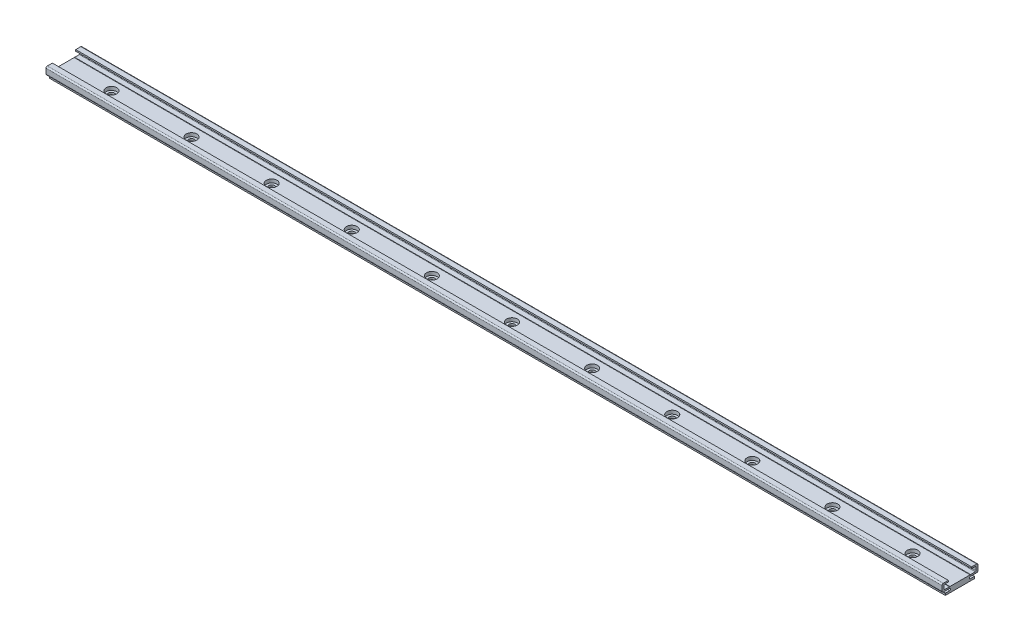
ISO-10303-21;
HEADER;
FILE_DESCRIPTION(('STEP AP214'),'2;1');
FILE_NAME('part.step','',(''),(''),'','','');
FILE_SCHEMA(('AUTOMOTIVE_DESIGN { 1 0 10303 214 1 1 1 1 }'));
ENDSEC;
DATA;
#1=APPLICATION_CONTEXT('core data for automotive mechanical design processes');
#2=APPLICATION_PROTOCOL_DEFINITION('international standard','automotive_design',2000,#1);
#3=PRODUCT_CONTEXT('',#1,'mechanical');
#4=PRODUCT('Part','Part','',(#3));
#5=PRODUCT_RELATED_PRODUCT_CATEGORY('part','',(#4));
#6=PRODUCT_DEFINITION_FORMATION('','',#4);
#7=PRODUCT_DEFINITION_CONTEXT('part definition',#1,'design');
#8=PRODUCT_DEFINITION('design','',#6,#7);
#9=PRODUCT_DEFINITION_SHAPE('','',#8);
#10=(LENGTH_UNIT() NAMED_UNIT(*) SI_UNIT(.MILLI.,.METRE.));
#11=(NAMED_UNIT(*) PLANE_ANGLE_UNIT() SI_UNIT($,.RADIAN.));
#12=(NAMED_UNIT(*) SI_UNIT($,.STERADIAN.) SOLID_ANGLE_UNIT());
#13=UNCERTAINTY_MEASURE_WITH_UNIT(LENGTH_MEASURE(1.E-05),#10,'distance_accuracy_value','');
#14=(GEOMETRIC_REPRESENTATION_CONTEXT(3) GLOBAL_UNCERTAINTY_ASSIGNED_CONTEXT((#13)) GLOBAL_UNIT_ASSIGNED_CONTEXT((#10,
#11,#12)) REPRESENTATION_CONTEXT('',''));
#15=CARTESIAN_POINT('',(0.,0.,0.));
#16=DIRECTION('',(0.,0.,1.));
#17=DIRECTION('',(1.,0.,0.));
#18=AXIS2_PLACEMENT_3D('',#15,#16,#17);
#19=CARTESIAN_POINT('',(3000.,4.1,-7.75));
#20=DIRECTION('',(1.,0.,0.));
#21=DIRECTION('',(0.,0.,-1.));
#22=AXIS2_PLACEMENT_3D('',#19,#20,#21);
#23=CYLINDRICAL_SURFACE('',#22,0.200000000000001);
#24=CARTESIAN_POINT('',(54.5,4.1,-7.75));
#25=DIRECTION('',(1.,0.,0.));
#26=DIRECTION('',(0.,0.,-1.));
#27=AXIS2_PLACEMENT_3D('',#24,#25,#26);
#28=CIRCLE('',#27,0.200000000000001);
#29=CARTESIAN_POINT('',(54.5,4.1,-7.55));
#30=VERTEX_POINT('',#29);
#31=CARTESIAN_POINT('',(54.5,4.1,-7.95));
#32=VERTEX_POINT('',#31);
#33=EDGE_CURVE('E245',#30,#32,#28,.T.);
#34=ORIENTED_EDGE('',*,*,#33,.F.);
#35=DIRECTION('',(1.,0.,0.));
#36=VECTOR('',#35,1.);
#37=CARTESIAN_POINT('',(3000.,4.1,-7.55));
#38=LINE('',#37,#36);
#39=CARTESIAN_POINT('',(725.5,4.10000000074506,-7.55));
#40=VERTEX_POINT('',#39);
#41=EDGE_CURVE('E240',#30,#40,#38,.T.);
#42=ORIENTED_EDGE('',*,*,#41,.T.);
#43=CARTESIAN_POINT('',(725.5,4.1,-7.75));
#44=DIRECTION('',(1.,0.,0.));
#45=DIRECTION('',(0.,0.,-1.));
#46=AXIS2_PLACEMENT_3D('',#43,#44,#45);
#47=CIRCLE('',#46,0.200000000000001);
#48=CARTESIAN_POINT('',(725.5,4.1,-7.95));
#49=VERTEX_POINT('',#48);
#50=EDGE_CURVE('E19',#49,#40,#47,.F.);
#51=ORIENTED_EDGE('',*,*,#50,.F.);
#52=DIRECTION('',(1.,0.,0.));
#53=VECTOR('',#52,1.);
#54=CARTESIAN_POINT('',(3000.,4.1,-7.95));
#55=LINE('',#54,#53);
#56=EDGE_CURVE('E237',#49,#32,#55,.F.);
#57=ORIENTED_EDGE('',*,*,#56,.T.);
#58=EDGE_LOOP('',(#34,#42,#51,#57));
#59=FACE_BOUND('',#58,.T.);
#60=ADVANCED_FACE('F16',(#59),#23,.F.);
#61=CARTESIAN_POINT('',(3000.,4.1,7.75));
#62=DIRECTION('',(1.,0.,0.));
#63=DIRECTION('',(0.,0.,-1.));
#64=AXIS2_PLACEMENT_3D('',#61,#62,#63);
#65=CYLINDRICAL_SURFACE('',#64,0.199999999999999);
#66=CARTESIAN_POINT('',(54.5,4.1,7.75));
#67=DIRECTION('',(1.,0.,0.));
#68=DIRECTION('',(0.,0.,-1.));
#69=AXIS2_PLACEMENT_3D('',#66,#67,#68);
#70=CIRCLE('',#69,0.199999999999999);
#71=CARTESIAN_POINT('',(54.5,4.1,7.95));
#72=VERTEX_POINT('',#71);
#73=CARTESIAN_POINT('',(54.5,4.1,7.55));
#74=VERTEX_POINT('',#73);
#75=EDGE_CURVE('E594',#72,#74,#70,.T.);
#76=ORIENTED_EDGE('',*,*,#75,.F.);
#77=DIRECTION('',(1.,0.,0.));
#78=VECTOR('',#77,1.);
#79=CARTESIAN_POINT('',(3000.,4.1,7.95));
#80=LINE('',#79,#78);
#81=CARTESIAN_POINT('',(725.5,4.1,7.95));
#82=VERTEX_POINT('',#81);
#83=EDGE_CURVE('E386',#72,#82,#80,.T.);
#84=ORIENTED_EDGE('',*,*,#83,.T.);
#85=CARTESIAN_POINT('',(725.5,4.1,7.75));
#86=DIRECTION('',(1.,0.,0.));
#87=DIRECTION('',(0.,0.,-1.));
#88=AXIS2_PLACEMENT_3D('',#85,#86,#87);
#89=CIRCLE('',#88,0.199999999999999);
#90=CARTESIAN_POINT('',(725.5,4.10000000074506,7.55));
#91=VERTEX_POINT('',#90);
#92=EDGE_CURVE('E596',#91,#82,#89,.F.);
#93=ORIENTED_EDGE('',*,*,#92,.F.);
#94=DIRECTION('',(1.,0.,0.));
#95=VECTOR('',#94,1.);
#96=CARTESIAN_POINT('',(3000.,4.1,7.55));
#97=LINE('',#96,#95);
#98=EDGE_CURVE('E395',#91,#74,#97,.F.);
#99=ORIENTED_EDGE('',*,*,#98,.T.);
#100=EDGE_LOOP('',(#76,#84,#93,#99));
#101=FACE_BOUND('',#100,.T.);
#102=ADVANCED_FACE('F718',(#101),#65,.F.);
#103=CARTESIAN_POINT('',(3000.,4.6,11.5));
#104=DIRECTION('',(1.,0.,0.));
#105=DIRECTION('',(0.,0.,-1.));
#106=AXIS2_PLACEMENT_3D('',#103,#104,#105);
#107=CYLINDRICAL_SURFACE('',#106,0.5);
#108=CARTESIAN_POINT('',(54.5,4.6,11.5));
#109=DIRECTION('',(1.,0.,0.));
#110=DIRECTION('',(0.,0.,-1.));
#111=AXIS2_PLACEMENT_3D('',#108,#109,#110);
#112=CIRCLE('',#111,0.5);
#113=CARTESIAN_POINT('',(54.5,4.6,12.));
#114=VERTEX_POINT('',#113);
#115=CARTESIAN_POINT('',(54.5,4.1,11.5));
#116=VERTEX_POINT('',#115);
#117=EDGE_CURVE('E590',#114,#116,#112,.T.);
#118=ORIENTED_EDGE('',*,*,#117,.F.);
#119=DIRECTION('',(1.,0.,0.));
#120=VECTOR('',#119,1.);
#121=CARTESIAN_POINT('',(3000.,4.6,12.));
#122=LINE('',#121,#120);
#123=CARTESIAN_POINT('',(725.5,4.6,12.));
#124=VERTEX_POINT('',#123);
#125=EDGE_CURVE('E378',#114,#124,#122,.T.);
#126=ORIENTED_EDGE('',*,*,#125,.T.);
#127=CARTESIAN_POINT('',(725.5,4.6,11.5));
#128=DIRECTION('',(1.,0.,0.));
#129=DIRECTION('',(0.,0.,-1.));
#130=AXIS2_PLACEMENT_3D('',#127,#128,#129);
#131=CIRCLE('',#130,0.5);
#132=CARTESIAN_POINT('',(725.5,4.1,11.5));
#133=VERTEX_POINT('',#132);
#134=EDGE_CURVE('E592',#133,#124,#131,.F.);
#135=ORIENTED_EDGE('',*,*,#134,.F.);
#136=DIRECTION('',(1.,0.,0.));
#137=VECTOR('',#136,1.);
#138=CARTESIAN_POINT('',(3000.,4.1,11.5));
#139=LINE('',#138,#137);
#140=EDGE_CURVE('E389',#133,#116,#139,.F.);
#141=ORIENTED_EDGE('',*,*,#140,.T.);
#142=EDGE_LOOP('',(#118,#126,#135,#141));
#143=FACE_BOUND('',#142,.T.);
#144=ADVANCED_FACE('F715',(#143),#107,.F.);
#145=CARTESIAN_POINT('',(3000.,7.1,11.5));
#146=DIRECTION('',(1.,0.,0.));
#147=DIRECTION('',(0.,0.,-1.));
#148=AXIS2_PLACEMENT_3D('',#145,#146,#147);
#149=CYLINDRICAL_SURFACE('',#148,0.5);
#150=CARTESIAN_POINT('',(54.5,7.1,11.5));
#151=DIRECTION('',(1.,0.,0.));
#152=DIRECTION('',(0.,0.,-1.));
#153=AXIS2_PLACEMENT_3D('',#150,#151,#152);
#154=CIRCLE('',#153,0.5);
#155=CARTESIAN_POINT('',(54.5,7.6,11.5));
#156=VERTEX_POINT('',#155);
#157=CARTESIAN_POINT('',(54.5,7.1,12.));
#158=VERTEX_POINT('',#157);
#159=EDGE_CURVE('E418',#156,#158,#154,.T.);
#160=ORIENTED_EDGE('',*,*,#159,.F.);
#161=DIRECTION('',(1.,0.,0.));
#162=VECTOR('',#161,1.);
#163=CARTESIAN_POINT('',(3000.,7.6,11.5));
#164=LINE('',#163,#162);
#165=CARTESIAN_POINT('',(725.5,7.6,11.5));
#166=VERTEX_POINT('',#165);
#167=EDGE_CURVE('E368',#156,#166,#164,.T.);
#168=ORIENTED_EDGE('',*,*,#167,.T.);
#169=CARTESIAN_POINT('',(725.5,7.1,11.5));
#170=DIRECTION('',(1.,0.,0.));
#171=DIRECTION('',(0.,0.,-1.));
#172=AXIS2_PLACEMENT_3D('',#169,#170,#171);
#173=CIRCLE('',#172,0.5);
#174=CARTESIAN_POINT('',(725.5,7.1,12.));
#175=VERTEX_POINT('',#174);
#176=EDGE_CURVE('E588',#175,#166,#173,.F.);
#177=ORIENTED_EDGE('',*,*,#176,.F.);
#178=DIRECTION('',(1.,0.,0.));
#179=VECTOR('',#178,1.);
#180=CARTESIAN_POINT('',(3000.,7.1,12.));
#181=LINE('',#180,#179);
#182=EDGE_CURVE('E383',#175,#158,#181,.F.);
#183=ORIENTED_EDGE('',*,*,#182,.T.);
#184=EDGE_LOOP('',(#160,#168,#177,#183));
#185=FACE_BOUND('',#184,.T.);
#186=ADVANCED_FACE('F725',(#185),#149,.F.);
#187=CARTESIAN_POINT('',(3000.,7.6,8.75));
#188=DIRECTION('',(0.,0.,1.));
#189=DIRECTION('',(1.,0.,0.));
#190=AXIS2_PLACEMENT_3D('',#187,#188,#189);
#191=PLANE('',#190);
#192=DIRECTION('',(0.,1.,0.));
#193=VECTOR('',#192,1.);
#194=CARTESIAN_POINT('',(54.5,7.6,8.75));
#195=LINE('',#194,#193);
#196=CARTESIAN_POINT('',(54.5,8.7,8.75));
#197=VERTEX_POINT('',#196);
#198=CARTESIAN_POINT('',(54.5,7.6,8.75));
#199=VERTEX_POINT('',#198);
#200=EDGE_CURVE('E411',#197,#199,#195,.F.);
#201=ORIENTED_EDGE('',*,*,#200,.F.);
#202=DIRECTION('',(1.,0.,0.));
#203=VECTOR('',#202,1.);
#204=CARTESIAN_POINT('',(3000.,8.7,8.75));
#205=LINE('',#204,#203);
#206=CARTESIAN_POINT('',(725.5,8.7,8.75));
#207=VERTEX_POINT('',#206);
#208=EDGE_CURVE('E364',#197,#207,#205,.T.);
#209=ORIENTED_EDGE('',*,*,#208,.T.);
#210=DIRECTION('',(0.,1.,0.));
#211=VECTOR('',#210,1.);
#212=CARTESIAN_POINT('',(725.5,7.6,8.75));
#213=LINE('',#212,#211);
#214=CARTESIAN_POINT('',(725.5,7.6,8.75));
#215=VERTEX_POINT('',#214);
#216=EDGE_CURVE('E414',#215,#207,#213,.T.);
#217=ORIENTED_EDGE('',*,*,#216,.F.);
#218=DIRECTION('',(1.,0.,0.));
#219=VECTOR('',#218,1.);
#220=CARTESIAN_POINT('',(3000.,7.6,8.75));
#221=LINE('',#220,#219);
#222=EDGE_CURVE('E375',#215,#199,#221,.F.);
#223=ORIENTED_EDGE('',*,*,#222,.T.);
#224=EDGE_LOOP('',(#201,#209,#217,#223));
#225=FACE_BOUND('',#224,.T.);
#226=ADVANCED_FACE('F974',(#225),#191,.F.);
#227=CARTESIAN_POINT('',(3000.,7.7,12.5));
#228=DIRECTION('',(1.,0.,0.));
#229=DIRECTION('',(0.,0.,-1.));
#230=AXIS2_PLACEMENT_3D('',#227,#228,#229);
#231=CYLINDRICAL_SURFACE('',#230,1.);
#232=CARTESIAN_POINT('',(725.5,7.7,12.5));
#233=DIRECTION('',(1.,0.,0.));
#234=DIRECTION('',(0.,0.,-1.));
#235=AXIS2_PLACEMENT_3D('',#232,#233,#234);
#236=CIRCLE('',#235,1.);
#237=CARTESIAN_POINT('',(725.5,7.7,13.5));
#238=VERTEX_POINT('',#237);
#239=CARTESIAN_POINT('',(725.5,8.7,12.5));
#240=VERTEX_POINT('',#239);
#241=EDGE_CURVE('E584',#238,#240,#236,.F.);
#242=ORIENTED_EDGE('',*,*,#241,.T.);
#243=DIRECTION('',(1.,0.,0.));
#244=VECTOR('',#243,1.);
#245=CARTESIAN_POINT('',(3000.,8.7,12.5));
#246=LINE('',#245,#244);
#247=CARTESIAN_POINT('',(54.5,8.7,12.5));
#248=VERTEX_POINT('',#247);
#249=EDGE_CURVE('E365',#240,#248,#246,.F.);
#250=ORIENTED_EDGE('',*,*,#249,.T.);
#251=CARTESIAN_POINT('',(54.5,7.7,12.5));
#252=DIRECTION('',(1.,0.,0.));
#253=DIRECTION('',(0.,0.,-1.));
#254=AXIS2_PLACEMENT_3D('',#251,#252,#253);
#255=CIRCLE('',#254,1.);
#256=CARTESIAN_POINT('',(54.5,7.7,13.5));
#257=VERTEX_POINT('',#256);
#258=EDGE_CURVE('E413',#248,#257,#255,.T.);
#259=ORIENTED_EDGE('',*,*,#258,.T.);
#260=DIRECTION('',(-1.,0.,0.));
#261=VECTOR('',#260,1.);
#262=CARTESIAN_POINT('',(3000.,7.7,13.5));
#263=LINE('',#262,#261);
#264=EDGE_CURVE('E358',#257,#238,#263,.F.);
#265=ORIENTED_EDGE('',*,*,#264,.T.);
#266=EDGE_LOOP('',(#242,#250,#259,#265));
#267=FACE_BOUND('',#266,.T.);
#268=ADVANCED_FACE('F970',(#267),#231,.T.);
#269=CARTESIAN_POINT('',(3000.,4.,12.5));
#270=DIRECTION('',(1.,0.,0.));
#271=DIRECTION('',(0.,0.,-1.));
#272=AXIS2_PLACEMENT_3D('',#269,#270,#271);
#273=CYLINDRICAL_SURFACE('',#272,1.);
#274=CARTESIAN_POINT('',(725.5,4.,12.5));
#275=DIRECTION('',(1.,0.,0.));
#276=DIRECTION('',(0.,0.,-1.));
#277=AXIS2_PLACEMENT_3D('',#274,#275,#276);
#278=CIRCLE('',#277,1.);
#279=CARTESIAN_POINT('',(725.5,3.,12.5));
#280=VERTEX_POINT('',#279);
#281=CARTESIAN_POINT('',(725.5,4.,13.5));
#282=VERTEX_POINT('',#281);
#283=EDGE_CURVE('E580',#280,#282,#278,.F.);
#284=ORIENTED_EDGE('',*,*,#283,.T.);
#285=DIRECTION('',(-1.,0.,0.));
#286=VECTOR('',#285,1.);
#287=CARTESIAN_POINT('',(3000.,4.,13.5));
#288=LINE('',#287,#286);
#289=CARTESIAN_POINT('',(54.5,4.,13.5));
#290=VERTEX_POINT('',#289);
#291=EDGE_CURVE('E361',#282,#290,#288,.T.);
#292=ORIENTED_EDGE('',*,*,#291,.T.);
#293=CARTESIAN_POINT('',(54.5,4.,12.5));
#294=DIRECTION('',(1.,0.,0.));
#295=DIRECTION('',(0.,0.,-1.));
#296=AXIS2_PLACEMENT_3D('',#293,#294,#295);
#297=CIRCLE('',#296,1.);
#298=CARTESIAN_POINT('',(54.5,3.,12.5));
#299=VERTEX_POINT('',#298);
#300=EDGE_CURVE('E582',#290,#299,#297,.T.);
#301=ORIENTED_EDGE('',*,*,#300,.T.);
#302=DIRECTION('',(1.,0.,0.));
#303=VECTOR('',#302,1.);
#304=CARTESIAN_POINT('',(3000.,3.,12.5));
#305=LINE('',#304,#303);
#306=EDGE_CURVE('E352',#299,#280,#305,.T.);
#307=ORIENTED_EDGE('',*,*,#306,.T.);
#308=EDGE_LOOP('',(#284,#292,#301,#307));
#309=FACE_BOUND('',#308,.T.);
#310=ADVANCED_FACE('F966',(#309),#273,.T.);
#311=CARTESIAN_POINT('',(3000.,2.25,7.8));
#312=DIRECTION('',(1.,0.,0.));
#313=DIRECTION('',(0.,0.,-1.));
#314=AXIS2_PLACEMENT_3D('',#311,#312,#313);
#315=CYLINDRICAL_SURFACE('',#314,0.75);
#316=CARTESIAN_POINT('',(54.5,2.25,7.8));
#317=DIRECTION('',(1.,0.,0.));
#318=DIRECTION('',(0.,0.,-1.));
#319=AXIS2_PLACEMENT_3D('',#316,#317,#318);
#320=CIRCLE('',#319,0.75);
#321=CARTESIAN_POINT('',(54.5,1.5,7.8));
#322=VERTEX_POINT('',#321);
#323=CARTESIAN_POINT('',(54.5,3.,7.8));
#324=VERTEX_POINT('',#323);
#325=EDGE_CURVE('E576',#322,#324,#320,.T.);
#326=ORIENTED_EDGE('',*,*,#325,.F.);
#327=DIRECTION('',(1.,0.,0.));
#328=VECTOR('',#327,1.);
#329=CARTESIAN_POINT('',(3000.,1.5,7.8));
#330=LINE('',#329,#328);
#331=CARTESIAN_POINT('',(725.5,1.5,7.8));
#332=VERTEX_POINT('',#331);
#333=EDGE_CURVE('E339',#322,#332,#330,.T.);
#334=ORIENTED_EDGE('',*,*,#333,.T.);
#335=CARTESIAN_POINT('',(725.5,2.25,7.8));
#336=DIRECTION('',(1.,0.,0.));
#337=DIRECTION('',(0.,0.,-1.));
#338=AXIS2_PLACEMENT_3D('',#335,#336,#337);
#339=CIRCLE('',#338,0.75);
#340=CARTESIAN_POINT('',(725.5,3.,7.8));
#341=VERTEX_POINT('',#340);
#342=EDGE_CURVE('E578',#341,#332,#339,.F.);
#343=ORIENTED_EDGE('',*,*,#342,.F.);
#344=DIRECTION('',(1.,0.,0.));
#345=VECTOR('',#344,1.);
#346=CARTESIAN_POINT('',(3000.,3.,7.8));
#347=LINE('',#346,#345);
#348=EDGE_CURVE('E355',#341,#324,#347,.F.);
#349=ORIENTED_EDGE('',*,*,#348,.T.);
#350=EDGE_LOOP('',(#326,#334,#343,#349));
#351=FACE_BOUND('',#350,.T.);
#352=ADVANCED_FACE('F962',(#351),#315,.F.);
#353=CARTESIAN_POINT('',(3000.,4.,-12.5));
#354=DIRECTION('',(1.,0.,0.));
#355=DIRECTION('',(0.,0.,-1.));
#356=AXIS2_PLACEMENT_3D('',#353,#354,#355);
#357=CYLINDRICAL_SURFACE('',#356,1.);
#358=CARTESIAN_POINT('',(725.5,4.,-12.5));
#359=DIRECTION('',(1.,0.,0.));
#360=DIRECTION('',(0.,0.,-1.));
#361=AXIS2_PLACEMENT_3D('',#358,#359,#360);
#362=CIRCLE('',#361,1.);
#363=CARTESIAN_POINT('',(725.5,4.,-13.5));
#364=VERTEX_POINT('',#363);
#365=CARTESIAN_POINT('',(725.5,3.,-12.5));
#366=VERTEX_POINT('',#365);
#367=EDGE_CURVE('E572',#364,#366,#362,.F.);
#368=ORIENTED_EDGE('',*,*,#367,.T.);
#369=DIRECTION('',(1.,0.,0.));
#370=VECTOR('',#369,1.);
#371=CARTESIAN_POINT('',(3000.,3.,-12.5));
#372=LINE('',#371,#370);
#373=CARTESIAN_POINT('',(54.5,3.,-12.5));
#374=VERTEX_POINT('',#373);
#375=EDGE_CURVE('E332',#366,#374,#372,.F.);
#376=ORIENTED_EDGE('',*,*,#375,.T.);
#377=CARTESIAN_POINT('',(54.5,4.,-12.5));
#378=DIRECTION('',(1.,0.,0.));
#379=DIRECTION('',(0.,0.,-1.));
#380=AXIS2_PLACEMENT_3D('',#377,#378,#379);
#381=CIRCLE('',#380,1.);
#382=CARTESIAN_POINT('',(54.5,4.,-13.5));
#383=VERTEX_POINT('',#382);
#384=EDGE_CURVE('E574',#374,#383,#381,.T.);
#385=ORIENTED_EDGE('',*,*,#384,.T.);
#386=DIRECTION('',(1.,0.,0.));
#387=VECTOR('',#386,1.);
#388=CARTESIAN_POINT('',(3000.,4.,-13.5));
#389=LINE('',#388,#387);
#390=EDGE_CURVE('E322',#383,#364,#389,.T.);
#391=ORIENTED_EDGE('',*,*,#390,.T.);
#392=EDGE_LOOP('',(#368,#376,#385,#391));
#393=FACE_BOUND('',#392,.T.);
#394=ADVANCED_FACE('F958',(#393),#357,.T.);
#395=CARTESIAN_POINT('',(3000.,7.7,-12.5));
#396=DIRECTION('',(1.,0.,0.));
#397=DIRECTION('',(0.,0.,-1.));
#398=AXIS2_PLACEMENT_3D('',#395,#396,#397);
#399=CYLINDRICAL_SURFACE('',#398,1.);
#400=CARTESIAN_POINT('',(725.5,7.7,-12.5));
#401=DIRECTION('',(1.,0.,0.));
#402=DIRECTION('',(0.,0.,-1.));
#403=AXIS2_PLACEMENT_3D('',#400,#401,#402);
#404=CIRCLE('',#403,1.);
#405=CARTESIAN_POINT('',(725.5,8.7,-12.5));
#406=VERTEX_POINT('',#405);
#407=CARTESIAN_POINT('',(725.5,7.7,-13.5));
#408=VERTEX_POINT('',#407);
#409=EDGE_CURVE('E408',#406,#408,#404,.F.);
#410=ORIENTED_EDGE('',*,*,#409,.T.);
#411=DIRECTION('',(1.,0.,0.));
#412=VECTOR('',#411,1.);
#413=CARTESIAN_POINT('',(3000.,7.7,-13.5));
#414=LINE('',#413,#412);
#415=CARTESIAN_POINT('',(54.5,7.7,-13.5));
#416=VERTEX_POINT('',#415);
#417=EDGE_CURVE('E327',#408,#416,#414,.F.);
#418=ORIENTED_EDGE('',*,*,#417,.T.);
#419=CARTESIAN_POINT('',(54.5,7.7,-12.5));
#420=DIRECTION('',(1.,0.,0.));
#421=DIRECTION('',(0.,0.,-1.));
#422=AXIS2_PLACEMENT_3D('',#419,#420,#421);
#423=CIRCLE('',#422,1.);
#424=CARTESIAN_POINT('',(54.5,8.7,-12.5));
#425=VERTEX_POINT('',#424);
#426=EDGE_CURVE('E570',#416,#425,#423,.T.);
#427=ORIENTED_EDGE('',*,*,#426,.T.);
#428=DIRECTION('',(1.,0.,0.));
#429=VECTOR('',#428,1.);
#430=CARTESIAN_POINT('',(3000.,8.7,-12.5));
#431=LINE('',#430,#429);
#432=EDGE_CURVE('E312',#425,#406,#431,.T.);
#433=ORIENTED_EDGE('',*,*,#432,.T.);
#434=EDGE_LOOP('',(#410,#418,#427,#433));
#435=FACE_BOUND('',#434,.T.);
#436=ADVANCED_FACE('F955',(#435),#399,.T.);
#437=CARTESIAN_POINT('',(3000.,8.7,-8.75));
#438=DIRECTION('',(0.,0.,-1.));
#439=DIRECTION('',(-1.,0.,0.));
#440=AXIS2_PLACEMENT_3D('',#437,#438,#439);
#441=PLANE('',#440);
#442=DIRECTION('',(0.,1.,0.));
#443=VECTOR('',#442,1.);
#444=CARTESIAN_POINT('',(54.5,8.7,-8.75));
#445=LINE('',#444,#443);
#446=CARTESIAN_POINT('',(54.5,7.6,-8.75));
#447=VERTEX_POINT('',#446);
#448=CARTESIAN_POINT('',(54.5,8.7,-8.75));
#449=VERTEX_POINT('',#448);
#450=EDGE_CURVE('E402',#447,#449,#445,.T.);
#451=ORIENTED_EDGE('',*,*,#450,.F.);
#452=DIRECTION('',(1.,0.,0.));
#453=VECTOR('',#452,1.);
#454=CARTESIAN_POINT('',(3000.,7.6,-8.75));
#455=LINE('',#454,#453);
#456=CARTESIAN_POINT('',(725.5,7.6,-8.75));
#457=VERTEX_POINT('',#456);
#458=EDGE_CURVE('E308',#447,#457,#455,.T.);
#459=ORIENTED_EDGE('',*,*,#458,.T.);
#460=DIRECTION('',(0.,1.,0.));
#461=VECTOR('',#460,1.);
#462=CARTESIAN_POINT('',(725.5,8.7,-8.75));
#463=LINE('',#462,#461);
#464=CARTESIAN_POINT('',(725.5,8.7,-8.75));
#465=VERTEX_POINT('',#464);
#466=EDGE_CURVE('E404',#465,#457,#463,.F.);
#467=ORIENTED_EDGE('',*,*,#466,.F.);
#468=DIRECTION('',(1.,0.,0.));
#469=VECTOR('',#468,1.);
#470=CARTESIAN_POINT('',(3000.,8.7,-8.75));
#471=LINE('',#470,#469);
#472=EDGE_CURVE('E319',#465,#449,#471,.F.);
#473=ORIENTED_EDGE('',*,*,#472,.T.);
#474=EDGE_LOOP('',(#451,#459,#467,#473));
#475=FACE_BOUND('',#474,.T.);
#476=ADVANCED_FACE('F658',(#475),#441,.F.);
#477=CARTESIAN_POINT('',(3000.,4.6,-11.5));
#478=DIRECTION('',(1.,0.,0.));
#479=DIRECTION('',(0.,0.,-1.));
#480=AXIS2_PLACEMENT_3D('',#477,#478,#479);
#481=CYLINDRICAL_SURFACE('',#480,0.5);
#482=CARTESIAN_POINT('',(54.5,4.6,-11.5));
#483=DIRECTION('',(1.,0.,0.));
#484=DIRECTION('',(0.,0.,-1.));
#485=AXIS2_PLACEMENT_3D('',#482,#483,#484);
#486=CIRCLE('',#485,0.5);
#487=CARTESIAN_POINT('',(54.5,4.1,-11.5));
#488=VERTEX_POINT('',#487);
#489=CARTESIAN_POINT('',(54.5,4.6,-12.));
#490=VERTEX_POINT('',#489);
#491=EDGE_CURVE('E566',#488,#490,#486,.T.);
#492=ORIENTED_EDGE('',*,*,#491,.F.);
#493=DIRECTION('',(1.,0.,0.));
#494=VECTOR('',#493,1.);
#495=CARTESIAN_POINT('',(3000.,4.1,-11.5));
#496=LINE('',#495,#494);
#497=CARTESIAN_POINT('',(725.5,4.1,-11.5));
#498=VERTEX_POINT('',#497);
#499=EDGE_CURVE('E253',#488,#498,#496,.T.);
#500=ORIENTED_EDGE('',*,*,#499,.T.);
#501=CARTESIAN_POINT('',(725.5,4.6,-11.5));
#502=DIRECTION('',(1.,0.,0.));
#503=DIRECTION('',(0.,0.,-1.));
#504=AXIS2_PLACEMENT_3D('',#501,#502,#503);
#505=CIRCLE('',#504,0.5);
#506=CARTESIAN_POINT('',(725.5,4.6,-12.));
#507=VERTEX_POINT('',#506);
#508=EDGE_CURVE('E258',#507,#498,#505,.F.);
#509=ORIENTED_EDGE('',*,*,#508,.F.);
#510=DIRECTION('',(-1.,0.,0.));
#511=VECTOR('',#510,1.);
#512=CARTESIAN_POINT('',(3000.,4.6,-12.));
#513=LINE('',#512,#511);
#514=EDGE_CURVE('E305',#507,#490,#513,.T.);
#515=ORIENTED_EDGE('',*,*,#514,.T.);
#516=EDGE_LOOP('',(#492,#500,#509,#515));
#517=FACE_BOUND('',#516,.T.);
#518=ADVANCED_FACE('F948',(#517),#481,.F.);
#519=CARTESIAN_POINT('',(3000.,7.1,-11.5));
#520=DIRECTION('',(1.,0.,0.));
#521=DIRECTION('',(0.,0.,-1.));
#522=AXIS2_PLACEMENT_3D('',#519,#520,#521);
#523=CYLINDRICAL_SURFACE('',#522,0.5);
#524=CARTESIAN_POINT('',(54.5,7.1,-11.5));
#525=DIRECTION('',(1.,0.,0.));
#526=DIRECTION('',(0.,0.,-1.));
#527=AXIS2_PLACEMENT_3D('',#524,#525,#526);
#528=CIRCLE('',#527,0.5);
#529=CARTESIAN_POINT('',(54.5,7.1,-12.));
#530=VERTEX_POINT('',#529);
#531=CARTESIAN_POINT('',(54.5,7.6,-11.5));
#532=VERTEX_POINT('',#531);
#533=EDGE_CURVE('E562',#530,#532,#528,.T.);
#534=ORIENTED_EDGE('',*,*,#533,.F.);
#535=DIRECTION('',(-1.,0.,0.));
#536=VECTOR('',#535,1.);
#537=CARTESIAN_POINT('',(3000.,7.1,-12.));
#538=LINE('',#537,#536);
#539=CARTESIAN_POINT('',(725.5,7.1,-12.));
#540=VERTEX_POINT('',#539);
#541=EDGE_CURVE('E301',#530,#540,#538,.F.);
#542=ORIENTED_EDGE('',*,*,#541,.T.);
#543=CARTESIAN_POINT('',(725.5,7.1,-11.5));
#544=DIRECTION('',(1.,0.,0.));
#545=DIRECTION('',(0.,0.,-1.));
#546=AXIS2_PLACEMENT_3D('',#543,#544,#545);
#547=CIRCLE('',#546,0.5);
#548=CARTESIAN_POINT('',(725.5,7.6,-11.5));
#549=VERTEX_POINT('',#548);
#550=EDGE_CURVE('E564',#549,#540,#547,.F.);
#551=ORIENTED_EDGE('',*,*,#550,.F.);
#552=DIRECTION('',(1.,0.,0.));
#553=VECTOR('',#552,1.);
#554=CARTESIAN_POINT('',(3000.,7.6,-11.5));
#555=LINE('',#554,#553);
#556=EDGE_CURVE('E309',#549,#532,#555,.F.);
#557=ORIENTED_EDGE('',*,*,#556,.T.);
#558=EDGE_LOOP('',(#534,#542,#551,#557));
#559=FACE_BOUND('',#558,.T.);
#560=ADVANCED_FACE('F944',(#559),#523,.F.);
#561=CARTESIAN_POINT('',(90.,0.,0.));
#562=DIRECTION('',(0.,1.,0.));
#563=DIRECTION('',(0.,0.,1.));
#564=AXIS2_PLACEMENT_3D('',#561,#562,#563);
#565=CYLINDRICAL_SURFACE('',#564,4.001);
#566=CARTESIAN_POINT('',(90.,4.1,0.));
#567=DIRECTION('',(0.,1.,0.));
#568=DIRECTION('',(0.,0.,1.));
#569=AXIS2_PLACEMENT_3D('',#566,#567,#568);
#570=CIRCLE('',#569,4.001);
#571=CARTESIAN_POINT('',(90.,4.1,4.001));
#572=VERTEX_POINT('',#571);
#573=EDGE_CURVE('E394',#572,#572,#570,.T.);
#574=ORIENTED_EDGE('',*,*,#573,.T.);
#575=EDGE_LOOP('',(#574));
#576=FACE_BOUND('',#575,.T.);
#577=CARTESIAN_POINT('',(90.,1.5,0.));
#578=DIRECTION('',(0.,1.,0.));
#579=DIRECTION('',(0.,0.,1.));
#580=AXIS2_PLACEMENT_3D('',#577,#578,#579);
#581=CIRCLE('',#580,4.001);
#582=CARTESIAN_POINT('',(90.,1.5,4.001));
#583=VERTEX_POINT('',#582);
#584=EDGE_CURVE('E349',#583,#583,#581,.T.);
#585=ORIENTED_EDGE('',*,*,#584,.F.);
#586=EDGE_LOOP('',(#585));
#587=FACE_BOUND('',#586,.T.);
#588=ADVANCED_FACE('F940',(#576,#587),#565,.F.);
#589=CARTESIAN_POINT('',(150.,0.,0.));
#590=DIRECTION('',(0.,1.,0.));
#591=DIRECTION('',(0.,0.,1.));
#592=AXIS2_PLACEMENT_3D('',#589,#590,#591);
#593=CYLINDRICAL_SURFACE('',#592,4.001);
#594=CARTESIAN_POINT('',(150.,4.1,0.));
#595=DIRECTION('',(0.,1.,0.));
#596=DIRECTION('',(0.,0.,1.));
#597=AXIS2_PLACEMENT_3D('',#594,#595,#596);
#598=CIRCLE('',#597,4.001);
#599=CARTESIAN_POINT('',(150.,4.1,4.001));
#600=VERTEX_POINT('',#599);
#601=EDGE_CURVE('E554',#600,#600,#598,.T.);
#602=ORIENTED_EDGE('',*,*,#601,.T.);
#603=EDGE_LOOP('',(#602));
#604=FACE_BOUND('',#603,.T.);
#605=CARTESIAN_POINT('',(150.,1.5,0.));
#606=DIRECTION('',(0.,1.,0.));
#607=DIRECTION('',(0.,0.,1.));
#608=AXIS2_PLACEMENT_3D('',#605,#606,#607);
#609=CIRCLE('',#608,4.001);
#610=CARTESIAN_POINT('',(150.,1.5,4.001));
#611=VERTEX_POINT('',#610);
#612=EDGE_CURVE('E523',#611,#611,#609,.T.);
#613=ORIENTED_EDGE('',*,*,#612,.F.);
#614=EDGE_LOOP('',(#613));
#615=FACE_BOUND('',#614,.T.);
#616=ADVANCED_FACE('F936',(#604,#615),#593,.F.);
#617=CARTESIAN_POINT('',(210.,0.,0.));
#618=DIRECTION('',(0.,1.,0.));
#619=DIRECTION('',(0.,0.,1.));
#620=AXIS2_PLACEMENT_3D('',#617,#618,#619);
#621=CYLINDRICAL_SURFACE('',#620,4.001);
#622=CARTESIAN_POINT('',(210.,4.1,0.));
#623=DIRECTION('',(0.,1.,0.));
#624=DIRECTION('',(0.,0.,1.));
#625=AXIS2_PLACEMENT_3D('',#622,#623,#624);
#626=CIRCLE('',#625,4.001);
#627=CARTESIAN_POINT('',(210.,4.1,4.001));
#628=VERTEX_POINT('',#627);
#629=EDGE_CURVE('E551',#628,#628,#626,.T.);
#630=ORIENTED_EDGE('',*,*,#629,.T.);
#631=EDGE_LOOP('',(#630));
#632=FACE_BOUND('',#631,.T.);
#633=CARTESIAN_POINT('',(210.,1.5,0.));
#634=DIRECTION('',(0.,1.,0.));
#635=DIRECTION('',(0.,0.,1.));
#636=AXIS2_PLACEMENT_3D('',#633,#634,#635);
#637=CIRCLE('',#636,4.001);
#638=CARTESIAN_POINT('',(210.,1.5,4.001));
#639=VERTEX_POINT('',#638);
#640=EDGE_CURVE('E520',#639,#639,#637,.T.);
#641=ORIENTED_EDGE('',*,*,#640,.F.);
#642=EDGE_LOOP('',(#641));
#643=FACE_BOUND('',#642,.T.);
#644=ADVANCED_FACE('F932',(#632,#643),#621,.F.);
#645=CARTESIAN_POINT('',(270.,0.,0.));
#646=DIRECTION('',(0.,1.,0.));
#647=DIRECTION('',(0.,0.,1.));
#648=AXIS2_PLACEMENT_3D('',#645,#646,#647);
#649=CYLINDRICAL_SURFACE('',#648,4.001);
#650=CARTESIAN_POINT('',(270.,4.1,0.));
#651=DIRECTION('',(0.,1.,0.));
#652=DIRECTION('',(0.,0.,1.));
#653=AXIS2_PLACEMENT_3D('',#650,#651,#652);
#654=CIRCLE('',#653,4.001);
#655=CARTESIAN_POINT('',(270.,4.1,4.001));
#656=VERTEX_POINT('',#655);
#657=EDGE_CURVE('E548',#656,#656,#654,.T.);
#658=ORIENTED_EDGE('',*,*,#657,.T.);
#659=EDGE_LOOP('',(#658));
#660=FACE_BOUND('',#659,.T.);
#661=CARTESIAN_POINT('',(270.,1.5,0.));
#662=DIRECTION('',(0.,1.,0.));
#663=DIRECTION('',(0.,0.,1.));
#664=AXIS2_PLACEMENT_3D('',#661,#662,#663);
#665=CIRCLE('',#664,4.001);
#666=CARTESIAN_POINT('',(270.,1.5,4.001));
#667=VERTEX_POINT('',#666);
#668=EDGE_CURVE('E517',#667,#667,#665,.T.);
#669=ORIENTED_EDGE('',*,*,#668,.F.);
#670=EDGE_LOOP('',(#669));
#671=FACE_BOUND('',#670,.T.);
#672=ADVANCED_FACE('F928',(#660,#671),#649,.F.);
#673=CARTESIAN_POINT('',(330.,0.,0.));
#674=DIRECTION('',(0.,1.,0.));
#675=DIRECTION('',(0.,0.,1.));
#676=AXIS2_PLACEMENT_3D('',#673,#674,#675);
#677=CYLINDRICAL_SURFACE('',#676,4.001);
#678=CARTESIAN_POINT('',(330.,4.1,0.));
#679=DIRECTION('',(0.,1.,0.));
#680=DIRECTION('',(0.,0.,1.));
#681=AXIS2_PLACEMENT_3D('',#678,#679,#680);
#682=CIRCLE('',#681,4.001);
#683=CARTESIAN_POINT('',(330.,4.1,4.001));
#684=VERTEX_POINT('',#683);
#685=EDGE_CURVE('E545',#684,#684,#682,.T.);
#686=ORIENTED_EDGE('',*,*,#685,.T.);
#687=EDGE_LOOP('',(#686));
#688=FACE_BOUND('',#687,.T.);
#689=CARTESIAN_POINT('',(330.,1.5,0.));
#690=DIRECTION('',(0.,1.,0.));
#691=DIRECTION('',(0.,0.,1.));
#692=AXIS2_PLACEMENT_3D('',#689,#690,#691);
#693=CIRCLE('',#692,4.001);
#694=CARTESIAN_POINT('',(330.,1.5,4.001));
#695=VERTEX_POINT('',#694);
#696=EDGE_CURVE('E514',#695,#695,#693,.T.);
#697=ORIENTED_EDGE('',*,*,#696,.F.);
#698=EDGE_LOOP('',(#697));
#699=FACE_BOUND('',#698,.T.);
#700=ADVANCED_FACE('F924',(#688,#699),#677,.F.);
#701=CARTESIAN_POINT('',(390.,0.,0.));
#702=DIRECTION('',(0.,1.,0.));
#703=DIRECTION('',(0.,0.,1.));
#704=AXIS2_PLACEMENT_3D('',#701,#702,#703);
#705=CYLINDRICAL_SURFACE('',#704,4.001);
#706=CARTESIAN_POINT('',(390.,4.1,0.));
#707=DIRECTION('',(0.,1.,0.));
#708=DIRECTION('',(0.,0.,1.));
#709=AXIS2_PLACEMENT_3D('',#706,#707,#708);
#710=CIRCLE('',#709,4.001);
#711=CARTESIAN_POINT('',(390.,4.1,4.001));
#712=VERTEX_POINT('',#711);
#713=EDGE_CURVE('E542',#712,#712,#710,.T.);
#714=ORIENTED_EDGE('',*,*,#713,.T.);
#715=EDGE_LOOP('',(#714));
#716=FACE_BOUND('',#715,.T.);
#717=CARTESIAN_POINT('',(390.,1.5,0.));
#718=DIRECTION('',(0.,1.,0.));
#719=DIRECTION('',(0.,0.,1.));
#720=AXIS2_PLACEMENT_3D('',#717,#718,#719);
#721=CIRCLE('',#720,4.001);
#722=CARTESIAN_POINT('',(390.,1.5,4.001));
#723=VERTEX_POINT('',#722);
#724=EDGE_CURVE('E511',#723,#723,#721,.T.);
#725=ORIENTED_EDGE('',*,*,#724,.F.);
#726=EDGE_LOOP('',(#725));
#727=FACE_BOUND('',#726,.T.);
#728=ADVANCED_FACE('F920',(#716,#727),#705,.F.);
#729=CARTESIAN_POINT('',(450.,0.,0.));
#730=DIRECTION('',(0.,1.,0.));
#731=DIRECTION('',(0.,0.,1.));
#732=AXIS2_PLACEMENT_3D('',#729,#730,#731);
#733=CYLINDRICAL_SURFACE('',#732,4.001);
#734=CARTESIAN_POINT('',(450.,4.1,0.));
#735=DIRECTION('',(0.,1.,0.));
#736=DIRECTION('',(0.,0.,1.));
#737=AXIS2_PLACEMENT_3D('',#734,#735,#736);
#738=CIRCLE('',#737,4.001);
#739=CARTESIAN_POINT('',(450.,4.1,4.001));
#740=VERTEX_POINT('',#739);
#741=EDGE_CURVE('E539',#740,#740,#738,.T.);
#742=ORIENTED_EDGE('',*,*,#741,.T.);
#743=EDGE_LOOP('',(#742));
#744=FACE_BOUND('',#743,.T.);
#745=CARTESIAN_POINT('',(450.,1.5,0.));
#746=DIRECTION('',(0.,1.,0.));
#747=DIRECTION('',(0.,0.,1.));
#748=AXIS2_PLACEMENT_3D('',#745,#746,#747);
#749=CIRCLE('',#748,4.001);
#750=CARTESIAN_POINT('',(450.,1.5,4.001));
#751=VERTEX_POINT('',#750);
#752=EDGE_CURVE('E508',#751,#751,#749,.T.);
#753=ORIENTED_EDGE('',*,*,#752,.F.);
#754=EDGE_LOOP('',(#753));
#755=FACE_BOUND('',#754,.T.);
#756=ADVANCED_FACE('F916',(#744,#755),#733,.F.);
#757=CARTESIAN_POINT('',(510.,0.,0.));
#758=DIRECTION('',(0.,1.,0.));
#759=DIRECTION('',(0.,0.,1.));
#760=AXIS2_PLACEMENT_3D('',#757,#758,#759);
#761=CYLINDRICAL_SURFACE('',#760,4.001);
#762=CARTESIAN_POINT('',(510.,4.1,0.));
#763=DIRECTION('',(0.,1.,0.));
#764=DIRECTION('',(0.,0.,1.));
#765=AXIS2_PLACEMENT_3D('',#762,#763,#764);
#766=CIRCLE('',#765,4.001);
#767=CARTESIAN_POINT('',(510.,4.1,4.001));
#768=VERTEX_POINT('',#767);
#769=EDGE_CURVE('E536',#768,#768,#766,.T.);
#770=ORIENTED_EDGE('',*,*,#769,.T.);
#771=EDGE_LOOP('',(#770));
#772=FACE_BOUND('',#771,.T.);
#773=CARTESIAN_POINT('',(510.,1.5,0.));
#774=DIRECTION('',(0.,1.,0.));
#775=DIRECTION('',(0.,0.,1.));
#776=AXIS2_PLACEMENT_3D('',#773,#774,#775);
#777=CIRCLE('',#776,4.001);
#778=CARTESIAN_POINT('',(510.,1.5,4.001));
#779=VERTEX_POINT('',#778);
#780=EDGE_CURVE('E505',#779,#779,#777,.T.);
#781=ORIENTED_EDGE('',*,*,#780,.F.);
#782=EDGE_LOOP('',(#781));
#783=FACE_BOUND('',#782,.T.);
#784=ADVANCED_FACE('F912',(#772,#783),#761,.F.);
#785=CARTESIAN_POINT('',(570.,0.,0.));
#786=DIRECTION('',(0.,1.,0.));
#787=DIRECTION('',(0.,0.,1.));
#788=AXIS2_PLACEMENT_3D('',#785,#786,#787);
#789=CYLINDRICAL_SURFACE('',#788,4.001);
#790=CARTESIAN_POINT('',(570.,4.1,0.));
#791=DIRECTION('',(0.,1.,0.));
#792=DIRECTION('',(0.,0.,1.));
#793=AXIS2_PLACEMENT_3D('',#790,#791,#792);
#794=CIRCLE('',#793,4.001);
#795=CARTESIAN_POINT('',(570.,4.1,4.001));
#796=VERTEX_POINT('',#795);
#797=EDGE_CURVE('E533',#796,#796,#794,.T.);
#798=ORIENTED_EDGE('',*,*,#797,.T.);
#799=EDGE_LOOP('',(#798));
#800=FACE_BOUND('',#799,.T.);
#801=CARTESIAN_POINT('',(570.,1.5,0.));
#802=DIRECTION('',(0.,1.,0.));
#803=DIRECTION('',(0.,0.,1.));
#804=AXIS2_PLACEMENT_3D('',#801,#802,#803);
#805=CIRCLE('',#804,4.001);
#806=CARTESIAN_POINT('',(570.,1.5,4.001));
#807=VERTEX_POINT('',#806);
#808=EDGE_CURVE('E502',#807,#807,#805,.T.);
#809=ORIENTED_EDGE('',*,*,#808,.F.);
#810=EDGE_LOOP('',(#809));
#811=FACE_BOUND('',#810,.T.);
#812=ADVANCED_FACE('F908',(#800,#811),#789,.F.);
#813=CARTESIAN_POINT('',(630.,0.,0.));
#814=DIRECTION('',(0.,1.,0.));
#815=DIRECTION('',(0.,0.,1.));
#816=AXIS2_PLACEMENT_3D('',#813,#814,#815);
#817=CYLINDRICAL_SURFACE('',#816,4.001);
#818=CARTESIAN_POINT('',(630.,4.1,0.));
#819=DIRECTION('',(0.,1.,0.));
#820=DIRECTION('',(0.,0.,1.));
#821=AXIS2_PLACEMENT_3D('',#818,#819,#820);
#822=CIRCLE('',#821,4.001);
#823=CARTESIAN_POINT('',(630.,4.1,4.001));
#824=VERTEX_POINT('',#823);
#825=EDGE_CURVE('E530',#824,#824,#822,.T.);
#826=ORIENTED_EDGE('',*,*,#825,.T.);
#827=EDGE_LOOP('',(#826));
#828=FACE_BOUND('',#827,.T.);
#829=CARTESIAN_POINT('',(630.,1.5,0.));
#830=DIRECTION('',(0.,1.,0.));
#831=DIRECTION('',(0.,0.,1.));
#832=AXIS2_PLACEMENT_3D('',#829,#830,#831);
#833=CIRCLE('',#832,4.001);
#834=CARTESIAN_POINT('',(630.,1.5,4.001));
#835=VERTEX_POINT('',#834);
#836=EDGE_CURVE('E267',#835,#835,#833,.T.);
#837=ORIENTED_EDGE('',*,*,#836,.F.);
#838=EDGE_LOOP('',(#837));
#839=FACE_BOUND('',#838,.T.);
#840=ADVANCED_FACE('F904',(#828,#839),#817,.F.);
#841=CARTESIAN_POINT('',(690.,0.,0.));
#842=DIRECTION('',(0.,1.,0.));
#843=DIRECTION('',(0.,0.,1.));
#844=AXIS2_PLACEMENT_3D('',#841,#842,#843);
#845=CYLINDRICAL_SURFACE('',#844,4.001);
#846=CARTESIAN_POINT('',(690.,4.1,0.));
#847=DIRECTION('',(0.,1.,0.));
#848=DIRECTION('',(0.,0.,1.));
#849=AXIS2_PLACEMENT_3D('',#846,#847,#848);
#850=CIRCLE('',#849,4.001);
#851=CARTESIAN_POINT('',(690.,4.1,4.001));
#852=VERTEX_POINT('',#851);
#853=EDGE_CURVE('E392',#852,#852,#850,.T.);
#854=ORIENTED_EDGE('',*,*,#853,.T.);
#855=EDGE_LOOP('',(#854));
#856=FACE_BOUND('',#855,.T.);
#857=CARTESIAN_POINT('',(690.,1.5,0.));
#858=DIRECTION('',(0.,1.,0.));
#859=DIRECTION('',(0.,0.,1.));
#860=AXIS2_PLACEMENT_3D('',#857,#858,#859);
#861=CIRCLE('',#860,4.001);
#862=CARTESIAN_POINT('',(690.,1.5,4.001));
#863=VERTEX_POINT('',#862);
#864=EDGE_CURVE('E261',#863,#863,#861,.T.);
#865=ORIENTED_EDGE('',*,*,#864,.F.);
#866=EDGE_LOOP('',(#865));
#867=FACE_BOUND('',#866,.T.);
#868=ADVANCED_FACE('F900',(#856,#867),#845,.F.);
#869=CARTESIAN_POINT('',(3000.,1.3,-10.8));
#870=DIRECTION('',(1.,0.,0.));
#871=DIRECTION('',(0.,0.,-1.));
#872=AXIS2_PLACEMENT_3D('',#869,#870,#871);
#873=CYLINDRICAL_SURFACE('',#872,0.199999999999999);
#874=CARTESIAN_POINT('',(725.5,1.3,-10.8));
#875=DIRECTION('',(1.,0.,0.));
#876=DIRECTION('',(0.,0.,-1.));
#877=AXIS2_PLACEMENT_3D('',#874,#875,#876);
#878=CIRCLE('',#877,0.199999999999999);
#879=CARTESIAN_POINT('',(725.5,1.5,-10.8));
#880=VERTEX_POINT('',#879);
#881=CARTESIAN_POINT('',(725.5,1.3,-11.));
#882=VERTEX_POINT('',#881);
#883=EDGE_CURVE('E493',#880,#882,#878,.F.);
#884=ORIENTED_EDGE('',*,*,#883,.T.);
#885=DIRECTION('',(1.,0.,0.));
#886=VECTOR('',#885,1.);
#887=CARTESIAN_POINT('',(3000.,1.3,-11.));
#888=LINE('',#887,#886);
#889=CARTESIAN_POINT('',(54.5,1.3,-11.));
#890=VERTEX_POINT('',#889);
#891=EDGE_CURVE('E340',#882,#890,#888,.F.);
#892=ORIENTED_EDGE('',*,*,#891,.T.);
#893=CARTESIAN_POINT('',(54.5,1.3,-10.8));
#894=DIRECTION('',(1.,0.,0.));
#895=DIRECTION('',(0.,0.,-1.));
#896=AXIS2_PLACEMENT_3D('',#893,#894,#895);
#897=CIRCLE('',#896,0.199999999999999);
#898=CARTESIAN_POINT('',(54.5,1.5,-10.8));
#899=VERTEX_POINT('',#898);
#900=EDGE_CURVE('E254',#890,#899,#897,.T.);
#901=ORIENTED_EDGE('',*,*,#900,.T.);
#902=DIRECTION('',(1.,0.,0.));
#903=VECTOR('',#902,1.);
#904=CARTESIAN_POINT('',(3000.,1.5,-10.8));
#905=LINE('',#904,#903);
#906=EDGE_CURVE('E337',#899,#880,#905,.T.);
#907=ORIENTED_EDGE('',*,*,#906,.T.);
#908=EDGE_LOOP('',(#884,#892,#901,#907));
#909=FACE_BOUND('',#908,.T.);
#910=ADVANCED_FACE('F897',(#909),#873,.T.);
#911=CARTESIAN_POINT('',(3000.,4.1,-11.5));
#912=DIRECTION('',(0.,-1.,0.));
#913=DIRECTION('',(0.,0.,-1.));
#914=AXIS2_PLACEMENT_3D('',#911,#912,#913);
#915=PLANE('',#914);
#916=DIRECTION('',(0.,0.,-1.));
#917=VECTOR('',#916,1.);
#918=CARTESIAN_POINT('',(54.5,4.1,-50.));
#919=LINE('',#918,#917);
#920=EDGE_CURVE('E252',#488,#32,#919,.F.);
#921=ORIENTED_EDGE('',*,*,#920,.T.);
#922=ORIENTED_EDGE('',*,*,#56,.F.);
#923=DIRECTION('',(0.,0.,1.));
#924=VECTOR('',#923,1.);
#925=CARTESIAN_POINT('',(725.5,4.1,-50.));
#926=LINE('',#925,#924);
#927=EDGE_CURVE('E250',#49,#498,#926,.F.);
#928=ORIENTED_EDGE('',*,*,#927,.T.);
#929=ORIENTED_EDGE('',*,*,#499,.F.);
#930=EDGE_LOOP('',(#921,#922,#928,#929));
#931=FACE_BOUND('',#930,.T.);
#932=ADVANCED_FACE('F248',(#931),#915,.F.);
#933=CARTESIAN_POINT('',(3000.,4.1,-7.55));
#934=DIRECTION('',(0.,-1.,0.));
#935=DIRECTION('',(0.,0.,-1.));
#936=AXIS2_PLACEMENT_3D('',#933,#934,#935);
#937=PLANE('',#936);
#938=ORIENTED_EDGE('',*,*,#853,.F.);
#939=EDGE_LOOP('',(#938));
#940=FACE_BOUND('',#939,.T.);
#941=ORIENTED_EDGE('',*,*,#825,.F.);
#942=EDGE_LOOP('',(#941));
#943=FACE_BOUND('',#942,.T.);
#944=ORIENTED_EDGE('',*,*,#797,.F.);
#945=EDGE_LOOP('',(#944));
#946=FACE_BOUND('',#945,.T.);
#947=ORIENTED_EDGE('',*,*,#769,.F.);
#948=EDGE_LOOP('',(#947));
#949=FACE_BOUND('',#948,.T.);
#950=ORIENTED_EDGE('',*,*,#741,.F.);
#951=EDGE_LOOP('',(#950));
#952=FACE_BOUND('',#951,.T.);
#953=ORIENTED_EDGE('',*,*,#713,.F.);
#954=EDGE_LOOP('',(#953));
#955=FACE_BOUND('',#954,.T.);
#956=ORIENTED_EDGE('',*,*,#685,.F.);
#957=EDGE_LOOP('',(#956));
#958=FACE_BOUND('',#957,.T.);
#959=ORIENTED_EDGE('',*,*,#657,.F.);
#960=EDGE_LOOP('',(#959));
#961=FACE_BOUND('',#960,.T.);
#962=ORIENTED_EDGE('',*,*,#629,.F.);
#963=EDGE_LOOP('',(#962));
#964=FACE_BOUND('',#963,.T.);
#965=ORIENTED_EDGE('',*,*,#601,.F.);
#966=EDGE_LOOP('',(#965));
#967=FACE_BOUND('',#966,.T.);
#968=ORIENTED_EDGE('',*,*,#573,.F.);
#969=EDGE_LOOP('',(#968));
#970=FACE_BOUND('',#969,.T.);
#971=DIRECTION('',(0.,0.,-1.));
#972=VECTOR('',#971,1.);
#973=CARTESIAN_POINT('',(54.5,4.1,-50.));
#974=LINE('',#973,#972);
#975=EDGE_CURVE('E602',#30,#74,#974,.F.);
#976=ORIENTED_EDGE('',*,*,#975,.T.);
#977=ORIENTED_EDGE('',*,*,#98,.F.);
#978=DIRECTION('',(0.,0.,1.));
#979=VECTOR('',#978,1.);
#980=CARTESIAN_POINT('',(725.5,4.10000000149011,-50.));
#981=LINE('',#980,#979);
#982=EDGE_CURVE('E399',#91,#40,#981,.F.);
#983=ORIENTED_EDGE('',*,*,#982,.T.);
#984=ORIENTED_EDGE('',*,*,#41,.F.);
#985=EDGE_LOOP('',(#976,#977,#983,#984));
#986=FACE_BOUND('',#985,.T.);
#987=ADVANCED_FACE('F604',(#940,#943,#946,#949,#952,#955,#958,#961,#964,#967,#970,#986),#937,.F.);
#988=CARTESIAN_POINT('',(3000.,4.1,7.95));
#989=DIRECTION('',(0.,-1.,0.));
#990=DIRECTION('',(0.,0.,-1.));
#991=AXIS2_PLACEMENT_3D('',#988,#989,#990);
#992=PLANE('',#991);
#993=DIRECTION('',(0.,0.,-1.));
#994=VECTOR('',#993,1.);
#995=CARTESIAN_POINT('',(54.5,4.1,-50.));
#996=LINE('',#995,#994);
#997=EDGE_CURVE('E704',#72,#116,#996,.F.);
#998=ORIENTED_EDGE('',*,*,#997,.T.);
#999=ORIENTED_EDGE('',*,*,#140,.F.);
#1000=DIRECTION('',(0.,0.,1.));
#1001=VECTOR('',#1000,1.);
#1002=CARTESIAN_POINT('',(725.5,4.1,-50.));
#1003=LINE('',#1002,#1001);
#1004=EDGE_CURVE('E606',#133,#82,#1003,.F.);
#1005=ORIENTED_EDGE('',*,*,#1004,.T.);
#1006=ORIENTED_EDGE('',*,*,#83,.F.);
#1007=EDGE_LOOP('',(#998,#999,#1005,#1006));
#1008=FACE_BOUND('',#1007,.T.);
#1009=ADVANCED_FACE('F710',(#1008),#992,.F.);
#1010=CARTESIAN_POINT('',(3000.,4.6,12.));
#1011=DIRECTION('',(0.,0.,1.));
#1012=DIRECTION('',(1.,0.,0.));
#1013=AXIS2_PLACEMENT_3D('',#1010,#1011,#1012);
#1014=PLANE('',#1013);
#1015=DIRECTION('',(0.,1.,0.));
#1016=VECTOR('',#1015,1.);
#1017=CARTESIAN_POINT('',(54.5,-50.,12.));
#1018=LINE('',#1017,#1016);
#1019=EDGE_CURVE('E699',#114,#158,#1018,.T.);
#1020=ORIENTED_EDGE('',*,*,#1019,.T.);
#1021=ORIENTED_EDGE('',*,*,#182,.F.);
#1022=DIRECTION('',(0.,1.,0.));
#1023=VECTOR('',#1022,1.);
#1024=CARTESIAN_POINT('',(725.5,-50.,12.));
#1025=LINE('',#1024,#1023);
#1026=EDGE_CURVE('E609',#175,#124,#1025,.F.);
#1027=ORIENTED_EDGE('',*,*,#1026,.T.);
#1028=ORIENTED_EDGE('',*,*,#125,.F.);
#1029=EDGE_LOOP('',(#1020,#1021,#1027,#1028));
#1030=FACE_BOUND('',#1029,.T.);
#1031=ADVANCED_FACE('F885',(#1030),#1014,.F.);
#1032=CARTESIAN_POINT('',(3000.,7.6,11.5));
#1033=DIRECTION('',(0.,1.,0.));
#1034=DIRECTION('',(0.,0.,1.));
#1035=AXIS2_PLACEMENT_3D('',#1032,#1033,#1034);
#1036=PLANE('',#1035);
#1037=DIRECTION('',(0.,0.,-1.));
#1038=VECTOR('',#1037,1.);
#1039=CARTESIAN_POINT('',(54.5,7.6,-50.));
#1040=LINE('',#1039,#1038);
#1041=EDGE_CURVE('E694',#156,#199,#1040,.T.);
#1042=ORIENTED_EDGE('',*,*,#1041,.T.);
#1043=ORIENTED_EDGE('',*,*,#222,.F.);
#1044=DIRECTION('',(0.,0.,1.));
#1045=VECTOR('',#1044,1.);
#1046=CARTESIAN_POINT('',(725.5,7.6,-50.));
#1047=LINE('',#1046,#1045);
#1048=EDGE_CURVE('E616',#215,#166,#1047,.T.);
#1049=ORIENTED_EDGE('',*,*,#1048,.T.);
#1050=ORIENTED_EDGE('',*,*,#167,.F.);
#1051=EDGE_LOOP('',(#1042,#1043,#1049,#1050));
#1052=FACE_BOUND('',#1051,.T.);
#1053=ADVANCED_FACE('F881',(#1052),#1036,.F.);
#1054=CARTESIAN_POINT('',(3000.,8.7,8.75));
#1055=DIRECTION('',(0.,-1.,0.));
#1056=DIRECTION('',(0.,0.,-1.));
#1057=AXIS2_PLACEMENT_3D('',#1054,#1055,#1056);
#1058=PLANE('',#1057);
#1059=DIRECTION('',(0.,0.,-1.));
#1060=VECTOR('',#1059,1.);
#1061=CARTESIAN_POINT('',(54.5,8.7,-50.));
#1062=LINE('',#1061,#1060);
#1063=EDGE_CURVE('E691',#197,#248,#1062,.F.);
#1064=ORIENTED_EDGE('',*,*,#1063,.T.);
#1065=ORIENTED_EDGE('',*,*,#249,.F.);
#1066=DIRECTION('',(0.,0.,1.));
#1067=VECTOR('',#1066,1.);
#1068=CARTESIAN_POINT('',(725.5,8.7,-50.));
#1069=LINE('',#1068,#1067);
#1070=EDGE_CURVE('E619',#240,#207,#1069,.F.);
#1071=ORIENTED_EDGE('',*,*,#1070,.T.);
#1072=ORIENTED_EDGE('',*,*,#208,.F.);
#1073=EDGE_LOOP('',(#1064,#1065,#1071,#1072));
#1074=FACE_BOUND('',#1073,.T.);
#1075=ADVANCED_FACE('F877',(#1074),#1058,.F.);
#1076=CARTESIAN_POINT('',(3000.,7.7,13.5));
#1077=DIRECTION('',(0.,0.,-1.));
#1078=DIRECTION('',(-1.,0.,0.));
#1079=AXIS2_PLACEMENT_3D('',#1076,#1077,#1078);
#1080=PLANE('',#1079);
#1081=DIRECTION('',(0.,1.,0.));
#1082=VECTOR('',#1081,1.);
#1083=CARTESIAN_POINT('',(54.5,-50.,13.5));
#1084=LINE('',#1083,#1082);
#1085=EDGE_CURVE('E688',#257,#290,#1084,.F.);
#1086=ORIENTED_EDGE('',*,*,#1085,.T.);
#1087=ORIENTED_EDGE('',*,*,#291,.F.);
#1088=DIRECTION('',(0.,1.,0.));
#1089=VECTOR('',#1088,1.);
#1090=CARTESIAN_POINT('',(725.5,-50.,13.5));
#1091=LINE('',#1090,#1089);
#1092=EDGE_CURVE('E624',#282,#238,#1091,.T.);
#1093=ORIENTED_EDGE('',*,*,#1092,.T.);
#1094=ORIENTED_EDGE('',*,*,#264,.F.);
#1095=EDGE_LOOP('',(#1086,#1087,#1093,#1094));
#1096=FACE_BOUND('',#1095,.T.);
#1097=ADVANCED_FACE('F873',(#1096),#1080,.F.);
#1098=CARTESIAN_POINT('',(3000.,3.,12.5));
#1099=DIRECTION('',(0.,1.,0.));
#1100=DIRECTION('',(0.,0.,1.));
#1101=AXIS2_PLACEMENT_3D('',#1098,#1099,#1100);
#1102=PLANE('',#1101);
#1103=DIRECTION('',(0.,0.,-1.));
#1104=VECTOR('',#1103,1.);
#1105=CARTESIAN_POINT('',(54.5,3.,-50.));
#1106=LINE('',#1105,#1104);
#1107=EDGE_CURVE('E685',#299,#324,#1106,.T.);
#1108=ORIENTED_EDGE('',*,*,#1107,.T.);
#1109=ORIENTED_EDGE('',*,*,#348,.F.);
#1110=DIRECTION('',(0.,0.,1.));
#1111=VECTOR('',#1110,1.);
#1112=CARTESIAN_POINT('',(725.5,3.,-50.));
#1113=LINE('',#1112,#1111);
#1114=EDGE_CURVE('E629',#341,#280,#1113,.T.);
#1115=ORIENTED_EDGE('',*,*,#1114,.T.);
#1116=ORIENTED_EDGE('',*,*,#306,.F.);
#1117=EDGE_LOOP('',(#1108,#1109,#1115,#1116));
#1118=FACE_BOUND('',#1117,.T.);
#1119=ADVANCED_FACE('F869',(#1118),#1102,.F.);
#1120=CARTESIAN_POINT('',(3000.,1.5,7.8));
#1121=DIRECTION('',(0.,-1.,0.));
#1122=DIRECTION('',(0.,0.,-1.));
#1123=AXIS2_PLACEMENT_3D('',#1120,#1121,#1122);
#1124=PLANE('',#1123);
#1125=DIRECTION('',(0.,0.,-1.));
#1126=VECTOR('',#1125,1.);
#1127=CARTESIAN_POINT('',(54.5,1.5,-50.));
#1128=LINE('',#1127,#1126);
#1129=CARTESIAN_POINT('',(54.5,1.5,10.8));
#1130=VERTEX_POINT('',#1129);
#1131=EDGE_CURVE('E488',#322,#1130,#1128,.F.);
#1132=ORIENTED_EDGE('',*,*,#1131,.T.);
#1133=DIRECTION('',(1.,0.,0.));
#1134=VECTOR('',#1133,1.);
#1135=CARTESIAN_POINT('',(3000.,1.5,10.8));
#1136=LINE('',#1135,#1134);
#1137=CARTESIAN_POINT('',(725.5,1.5,10.8));
#1138=VERTEX_POINT('',#1137);
#1139=EDGE_CURVE('E304',#1138,#1130,#1136,.F.);
#1140=ORIENTED_EDGE('',*,*,#1139,.F.);
#1141=DIRECTION('',(0.,0.,1.));
#1142=VECTOR('',#1141,1.);
#1143=CARTESIAN_POINT('',(725.5,1.5,-50.));
#1144=LINE('',#1143,#1142);
#1145=EDGE_CURVE('E492',#1138,#332,#1144,.F.);
#1146=ORIENTED_EDGE('',*,*,#1145,.T.);
#1147=ORIENTED_EDGE('',*,*,#333,.F.);
#1148=EDGE_LOOP('',(#1132,#1140,#1146,#1147));
#1149=FACE_BOUND('',#1148,.T.);
#1150=ADVANCED_FACE('F865',(#1149),#1124,.F.);
#1151=CARTESIAN_POINT('',(3000.,1.5,-10.8));
#1152=DIRECTION('',(0.,-1.,0.));
#1153=DIRECTION('',(0.,0.,-1.));
#1154=AXIS2_PLACEMENT_3D('',#1151,#1152,#1153);
#1155=PLANE('',#1154);
#1156=DIRECTION('',(0.,0.,-1.));
#1157=VECTOR('',#1156,1.);
#1158=CARTESIAN_POINT('',(54.5,1.5,-50.));
#1159=LINE('',#1158,#1157);
#1160=CARTESIAN_POINT('',(54.5,1.5,-7.8));
#1161=VERTEX_POINT('',#1160);
#1162=EDGE_CURVE('E484',#899,#1161,#1159,.F.);
#1163=ORIENTED_EDGE('',*,*,#1162,.T.);
#1164=DIRECTION('',(1.,0.,0.));
#1165=VECTOR('',#1164,1.);
#1166=CARTESIAN_POINT('',(3000.,1.5,-7.8));
#1167=LINE('',#1166,#1165);
#1168=CARTESIAN_POINT('',(725.5,1.5,-7.8));
#1169=VERTEX_POINT('',#1168);
#1170=EDGE_CURVE('E335',#1161,#1169,#1167,.T.);
#1171=ORIENTED_EDGE('',*,*,#1170,.T.);
#1172=DIRECTION('',(0.,0.,1.));
#1173=VECTOR('',#1172,1.);
#1174=CARTESIAN_POINT('',(725.5,1.5,-50.));
#1175=LINE('',#1174,#1173);
#1176=EDGE_CURVE('E495',#1169,#880,#1175,.F.);
#1177=ORIENTED_EDGE('',*,*,#1176,.T.);
#1178=ORIENTED_EDGE('',*,*,#906,.F.);
#1179=EDGE_LOOP('',(#1163,#1171,#1177,#1178));
#1180=FACE_BOUND('',#1179,.T.);
#1181=ADVANCED_FACE('F861',(#1180),#1155,.F.);
#1182=CARTESIAN_POINT('',(3000.,2.25,-7.8));
#1183=DIRECTION('',(1.,0.,0.));
#1184=DIRECTION('',(0.,0.,-1.));
#1185=AXIS2_PLACEMENT_3D('',#1182,#1183,#1184);
#1186=CYLINDRICAL_SURFACE('',#1185,0.750000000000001);
#1187=CARTESIAN_POINT('',(54.5,2.25,-7.8));
#1188=DIRECTION('',(1.,0.,0.));
#1189=DIRECTION('',(0.,0.,-1.));
#1190=AXIS2_PLACEMENT_3D('',#1187,#1188,#1189);
#1191=CIRCLE('',#1190,0.750000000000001);
#1192=CARTESIAN_POINT('',(54.5,3.,-7.8));
#1193=VERTEX_POINT('',#1192);
#1194=EDGE_CURVE('E480',#1161,#1193,#1191,.F.);
#1195=ORIENTED_EDGE('',*,*,#1194,.T.);
#1196=DIRECTION('',(1.,0.,0.));
#1197=VECTOR('',#1196,1.);
#1198=CARTESIAN_POINT('',(3000.,3.,-7.8));
#1199=LINE('',#1198,#1197);
#1200=CARTESIAN_POINT('',(725.5,3.,-7.8));
#1201=VERTEX_POINT('',#1200);
#1202=EDGE_CURVE('E330',#1193,#1201,#1199,.T.);
#1203=ORIENTED_EDGE('',*,*,#1202,.T.);
#1204=CARTESIAN_POINT('',(725.5,2.25,-7.8));
#1205=DIRECTION('',(1.,0.,0.));
#1206=DIRECTION('',(0.,0.,-1.));
#1207=AXIS2_PLACEMENT_3D('',#1204,#1205,#1206);
#1208=CIRCLE('',#1207,0.750000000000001);
#1209=EDGE_CURVE('E496',#1201,#1169,#1208,.T.);
#1210=ORIENTED_EDGE('',*,*,#1209,.T.);
#1211=ORIENTED_EDGE('',*,*,#1170,.F.);
#1212=EDGE_LOOP('',(#1195,#1203,#1210,#1211));
#1213=FACE_BOUND('',#1212,.T.);
#1214=ADVANCED_FACE('F857',(#1213),#1186,.F.);
#1215=CARTESIAN_POINT('',(3000.,3.,-7.8));
#1216=DIRECTION('',(0.,1.,0.));
#1217=DIRECTION('',(0.,0.,1.));
#1218=AXIS2_PLACEMENT_3D('',#1215,#1216,#1217);
#1219=PLANE('',#1218);
#1220=DIRECTION('',(0.,0.,-1.));
#1221=VECTOR('',#1220,1.);
#1222=CARTESIAN_POINT('',(54.5,3.,-50.));
#1223=LINE('',#1222,#1221);
#1224=EDGE_CURVE('E483',#1193,#374,#1223,.T.);
#1225=ORIENTED_EDGE('',*,*,#1224,.T.);
#1226=ORIENTED_EDGE('',*,*,#375,.F.);
#1227=DIRECTION('',(0.,0.,1.));
#1228=VECTOR('',#1227,1.);
#1229=CARTESIAN_POINT('',(725.5,3.,-50.));
#1230=LINE('',#1229,#1228);
#1231=EDGE_CURVE('E498',#366,#1201,#1230,.T.);
#1232=ORIENTED_EDGE('',*,*,#1231,.T.);
#1233=ORIENTED_EDGE('',*,*,#1202,.F.);
#1234=EDGE_LOOP('',(#1225,#1226,#1232,#1233));
#1235=FACE_BOUND('',#1234,.T.);
#1236=ADVANCED_FACE('F853',(#1235),#1219,.F.);
#1237=CARTESIAN_POINT('',(3000.,4.,-13.5));
#1238=DIRECTION('',(0.,0.,1.));
#1239=DIRECTION('',(1.,0.,0.));
#1240=AXIS2_PLACEMENT_3D('',#1237,#1238,#1239);
#1241=PLANE('',#1240);
#1242=DIRECTION('',(0.,1.,0.));
#1243=VECTOR('',#1242,1.);
#1244=CARTESIAN_POINT('',(54.5,-50.,-13.5));
#1245=LINE('',#1244,#1243);
#1246=EDGE_CURVE('E666',#383,#416,#1245,.T.);
#1247=ORIENTED_EDGE('',*,*,#1246,.T.);
#1248=ORIENTED_EDGE('',*,*,#417,.F.);
#1249=DIRECTION('',(0.,1.,0.));
#1250=VECTOR('',#1249,1.);
#1251=CARTESIAN_POINT('',(725.5,-50.,-13.5));
#1252=LINE('',#1251,#1250);
#1253=EDGE_CURVE('E638',#408,#364,#1252,.F.);
#1254=ORIENTED_EDGE('',*,*,#1253,.T.);
#1255=ORIENTED_EDGE('',*,*,#390,.F.);
#1256=EDGE_LOOP('',(#1247,#1248,#1254,#1255));
#1257=FACE_BOUND('',#1256,.T.);
#1258=ADVANCED_FACE('F849',(#1257),#1241,.F.);
#1259=CARTESIAN_POINT('',(3000.,8.7,-12.5));
#1260=DIRECTION('',(0.,-1.,0.));
#1261=DIRECTION('',(0.,0.,-1.));
#1262=AXIS2_PLACEMENT_3D('',#1259,#1260,#1261);
#1263=PLANE('',#1262);
#1264=DIRECTION('',(0.,0.,-1.));
#1265=VECTOR('',#1264,1.);
#1266=CARTESIAN_POINT('',(54.5,8.7,-50.));
#1267=LINE('',#1266,#1265);
#1268=EDGE_CURVE('E661',#425,#449,#1267,.F.);
#1269=ORIENTED_EDGE('',*,*,#1268,.T.);
#1270=ORIENTED_EDGE('',*,*,#472,.F.);
#1271=DIRECTION('',(0.,0.,1.));
#1272=VECTOR('',#1271,1.);
#1273=CARTESIAN_POINT('',(725.5,8.7,-50.));
#1274=LINE('',#1273,#1272);
#1275=EDGE_CURVE('E641',#465,#406,#1274,.F.);
#1276=ORIENTED_EDGE('',*,*,#1275,.T.);
#1277=ORIENTED_EDGE('',*,*,#432,.F.);
#1278=EDGE_LOOP('',(#1269,#1270,#1276,#1277));
#1279=FACE_BOUND('',#1278,.T.);
#1280=ADVANCED_FACE('F846',(#1279),#1263,.F.);
#1281=CARTESIAN_POINT('',(3000.,7.6,-8.75));
#1282=DIRECTION('',(0.,1.,0.));
#1283=DIRECTION('',(0.,0.,1.));
#1284=AXIS2_PLACEMENT_3D('',#1281,#1282,#1283);
#1285=PLANE('',#1284);
#1286=DIRECTION('',(0.,0.,-1.));
#1287=VECTOR('',#1286,1.);
#1288=CARTESIAN_POINT('',(54.5,7.6,-50.));
#1289=LINE('',#1288,#1287);
#1290=EDGE_CURVE('E662',#447,#532,#1289,.T.);
#1291=ORIENTED_EDGE('',*,*,#1290,.T.);
#1292=ORIENTED_EDGE('',*,*,#556,.F.);
#1293=DIRECTION('',(0.,0.,1.));
#1294=VECTOR('',#1293,1.);
#1295=CARTESIAN_POINT('',(725.5,7.6,-50.));
#1296=LINE('',#1295,#1294);
#1297=EDGE_CURVE('E264',#549,#457,#1296,.T.);
#1298=ORIENTED_EDGE('',*,*,#1297,.T.);
#1299=ORIENTED_EDGE('',*,*,#458,.F.);
#1300=EDGE_LOOP('',(#1291,#1292,#1298,#1299));
#1301=FACE_BOUND('',#1300,.T.);
#1302=ADVANCED_FACE('F653',(#1301),#1285,.F.);
#1303=CARTESIAN_POINT('',(3000.,7.1,-12.));
#1304=DIRECTION('',(0.,0.,-1.));
#1305=DIRECTION('',(-1.,0.,0.));
#1306=AXIS2_PLACEMENT_3D('',#1303,#1304,#1305);
#1307=PLANE('',#1306);
#1308=DIRECTION('',(0.,1.,0.));
#1309=VECTOR('',#1308,1.);
#1310=CARTESIAN_POINT('',(54.5,-50.,-12.));
#1311=LINE('',#1310,#1309);
#1312=EDGE_CURVE('E292',#530,#490,#1311,.F.);
#1313=ORIENTED_EDGE('',*,*,#1312,.T.);
#1314=ORIENTED_EDGE('',*,*,#514,.F.);
#1315=DIRECTION('',(0.,1.,0.));
#1316=VECTOR('',#1315,1.);
#1317=CARTESIAN_POINT('',(725.5,-50.,-12.));
#1318=LINE('',#1317,#1316);
#1319=EDGE_CURVE('E260',#507,#540,#1318,.T.);
#1320=ORIENTED_EDGE('',*,*,#1319,.T.);
#1321=ORIENTED_EDGE('',*,*,#541,.F.);
#1322=EDGE_LOOP('',(#1313,#1314,#1320,#1321));
#1323=FACE_BOUND('',#1322,.T.);
#1324=ADVANCED_FACE('F839',(#1323),#1307,.F.);
#1325=CARTESIAN_POINT('',(3000.,1.3,10.8));
#1326=DIRECTION('',(1.,0.,0.));
#1327=DIRECTION('',(0.,0.,-1.));
#1328=AXIS2_PLACEMENT_3D('',#1325,#1326,#1327);
#1329=CYLINDRICAL_SURFACE('',#1328,0.199999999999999);
#1330=CARTESIAN_POINT('',(725.5,1.3,10.8));
#1331=DIRECTION('',(1.,0.,0.));
#1332=DIRECTION('',(0.,0.,-1.));
#1333=AXIS2_PLACEMENT_3D('',#1330,#1331,#1332);
#1334=CIRCLE('',#1333,0.199999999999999);
#1335=CARTESIAN_POINT('',(725.5,1.3,11.));
#1336=VERTEX_POINT('',#1335);
#1337=EDGE_CURVE('E489',#1336,#1138,#1334,.F.);
#1338=ORIENTED_EDGE('',*,*,#1337,.T.);
#1339=ORIENTED_EDGE('',*,*,#1139,.T.);
#1340=CARTESIAN_POINT('',(54.5,1.3,10.8));
#1341=DIRECTION('',(1.,0.,0.));
#1342=DIRECTION('',(0.,0.,-1.));
#1343=AXIS2_PLACEMENT_3D('',#1340,#1341,#1342);
#1344=CIRCLE('',#1343,0.199999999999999);
#1345=CARTESIAN_POINT('',(54.5,1.3,11.));
#1346=VERTEX_POINT('',#1345);
#1347=EDGE_CURVE('E485',#1130,#1346,#1344,.T.);
#1348=ORIENTED_EDGE('',*,*,#1347,.T.);
#1349=DIRECTION('',(-1.,0.,0.));
#1350=VECTOR('',#1349,1.);
#1351=CARTESIAN_POINT('',(3000.,1.3,11.));
#1352=LINE('',#1351,#1350);
#1353=EDGE_CURVE('E271',#1346,#1336,#1352,.F.);
#1354=ORIENTED_EDGE('',*,*,#1353,.T.);
#1355=EDGE_LOOP('',(#1338,#1339,#1348,#1354));
#1356=FACE_BOUND('',#1355,.T.);
#1357=ADVANCED_FACE('F835',(#1356),#1329,.T.);
#1358=CARTESIAN_POINT('',(94.001,1.5,0.));
#1359=DIRECTION('',(0.,1.,0.));
#1360=DIRECTION('',(0.,0.,1.));
#1361=AXIS2_PLACEMENT_3D('',#1358,#1359,#1360);
#1362=PLANE('',#1361);
#1363=CARTESIAN_POINT('',(90.,1.5,0.));
#1364=DIRECTION('',(0.,1.,0.));
#1365=DIRECTION('',(0.,0.,1.));
#1366=AXIS2_PLACEMENT_3D('',#1363,#1364,#1365);
#1367=CIRCLE('',#1366,2.25);
#1368=CARTESIAN_POINT('',(90.,1.5,2.25));
#1369=VERTEX_POINT('',#1368);
#1370=EDGE_CURVE('E274',#1369,#1369,#1367,.F.);
#1371=ORIENTED_EDGE('',*,*,#1370,.T.);
#1372=EDGE_LOOP('',(#1371));
#1373=FACE_BOUND('',#1372,.T.);
#1374=ORIENTED_EDGE('',*,*,#584,.T.);
#1375=EDGE_LOOP('',(#1374));
#1376=FACE_BOUND('',#1375,.T.);
#1377=ADVANCED_FACE('F831',(#1373,#1376),#1362,.T.);
#1378=CARTESIAN_POINT('',(154.001,1.5,0.));
#1379=DIRECTION('',(0.,1.,0.));
#1380=DIRECTION('',(0.,0.,1.));
#1381=AXIS2_PLACEMENT_3D('',#1378,#1379,#1380);
#1382=PLANE('',#1381);
#1383=CARTESIAN_POINT('',(150.,1.5,0.));
#1384=DIRECTION('',(0.,1.,0.));
#1385=DIRECTION('',(0.,0.,1.));
#1386=AXIS2_PLACEMENT_3D('',#1383,#1384,#1385);
#1387=CIRCLE('',#1386,2.25);
#1388=CARTESIAN_POINT('',(150.,1.5,2.25));
#1389=VERTEX_POINT('',#1388);
#1390=EDGE_CURVE('E475',#1389,#1389,#1387,.F.);
#1391=ORIENTED_EDGE('',*,*,#1390,.T.);
#1392=EDGE_LOOP('',(#1391));
#1393=FACE_BOUND('',#1392,.T.);
#1394=ORIENTED_EDGE('',*,*,#612,.T.);
#1395=EDGE_LOOP('',(#1394));
#1396=FACE_BOUND('',#1395,.T.);
#1397=ADVANCED_FACE('F827',(#1393,#1396),#1382,.T.);
#1398=CARTESIAN_POINT('',(214.001,1.5,0.));
#1399=DIRECTION('',(0.,1.,0.));
#1400=DIRECTION('',(0.,0.,1.));
#1401=AXIS2_PLACEMENT_3D('',#1398,#1399,#1400);
#1402=PLANE('',#1401);
#1403=CARTESIAN_POINT('',(210.,1.5,0.));
#1404=DIRECTION('',(0.,1.,0.));
#1405=DIRECTION('',(0.,0.,1.));
#1406=AXIS2_PLACEMENT_3D('',#1403,#1404,#1405);
#1407=CIRCLE('',#1406,2.25);
#1408=CARTESIAN_POINT('',(210.,1.5,2.25));
#1409=VERTEX_POINT('',#1408);
#1410=EDGE_CURVE('E472',#1409,#1409,#1407,.F.);
#1411=ORIENTED_EDGE('',*,*,#1410,.T.);
#1412=EDGE_LOOP('',(#1411));
#1413=FACE_BOUND('',#1412,.T.);
#1414=ORIENTED_EDGE('',*,*,#640,.T.);
#1415=EDGE_LOOP('',(#1414));
#1416=FACE_BOUND('',#1415,.T.);
#1417=ADVANCED_FACE('F823',(#1413,#1416),#1402,.T.);
#1418=CARTESIAN_POINT('',(274.001,1.5,0.));
#1419=DIRECTION('',(0.,1.,0.));
#1420=DIRECTION('',(0.,0.,1.));
#1421=AXIS2_PLACEMENT_3D('',#1418,#1419,#1420);
#1422=PLANE('',#1421);
#1423=CARTESIAN_POINT('',(270.,1.5,0.));
#1424=DIRECTION('',(0.,1.,0.));
#1425=DIRECTION('',(0.,0.,1.));
#1426=AXIS2_PLACEMENT_3D('',#1423,#1424,#1425);
#1427=CIRCLE('',#1426,2.25);
#1428=CARTESIAN_POINT('',(270.,1.5,2.25));
#1429=VERTEX_POINT('',#1428);
#1430=EDGE_CURVE('E469',#1429,#1429,#1427,.F.);
#1431=ORIENTED_EDGE('',*,*,#1430,.T.);
#1432=EDGE_LOOP('',(#1431));
#1433=FACE_BOUND('',#1432,.T.);
#1434=ORIENTED_EDGE('',*,*,#668,.T.);
#1435=EDGE_LOOP('',(#1434));
#1436=FACE_BOUND('',#1435,.T.);
#1437=ADVANCED_FACE('F819',(#1433,#1436),#1422,.T.);
#1438=CARTESIAN_POINT('',(334.001,1.5,0.));
#1439=DIRECTION('',(0.,1.,0.));
#1440=DIRECTION('',(0.,0.,1.));
#1441=AXIS2_PLACEMENT_3D('',#1438,#1439,#1440);
#1442=PLANE('',#1441);
#1443=CARTESIAN_POINT('',(330.,1.5,0.));
#1444=DIRECTION('',(0.,1.,0.));
#1445=DIRECTION('',(0.,0.,1.));
#1446=AXIS2_PLACEMENT_3D('',#1443,#1444,#1445);
#1447=CIRCLE('',#1446,2.25);
#1448=CARTESIAN_POINT('',(330.,1.5,2.25));
#1449=VERTEX_POINT('',#1448);
#1450=EDGE_CURVE('E466',#1449,#1449,#1447,.F.);
#1451=ORIENTED_EDGE('',*,*,#1450,.T.);
#1452=EDGE_LOOP('',(#1451));
#1453=FACE_BOUND('',#1452,.T.);
#1454=ORIENTED_EDGE('',*,*,#696,.T.);
#1455=EDGE_LOOP('',(#1454));
#1456=FACE_BOUND('',#1455,.T.);
#1457=ADVANCED_FACE('F815',(#1453,#1456),#1442,.T.);
#1458=CARTESIAN_POINT('',(394.001,1.5,0.));
#1459=DIRECTION('',(0.,1.,0.));
#1460=DIRECTION('',(0.,0.,1.));
#1461=AXIS2_PLACEMENT_3D('',#1458,#1459,#1460);
#1462=PLANE('',#1461);
#1463=CARTESIAN_POINT('',(390.,1.5,0.));
#1464=DIRECTION('',(0.,1.,0.));
#1465=DIRECTION('',(0.,0.,1.));
#1466=AXIS2_PLACEMENT_3D('',#1463,#1464,#1465);
#1467=CIRCLE('',#1466,2.25);
#1468=CARTESIAN_POINT('',(390.,1.5,2.25));
#1469=VERTEX_POINT('',#1468);
#1470=EDGE_CURVE('E463',#1469,#1469,#1467,.F.);
#1471=ORIENTED_EDGE('',*,*,#1470,.T.);
#1472=EDGE_LOOP('',(#1471));
#1473=FACE_BOUND('',#1472,.T.);
#1474=ORIENTED_EDGE('',*,*,#724,.T.);
#1475=EDGE_LOOP('',(#1474));
#1476=FACE_BOUND('',#1475,.T.);
#1477=ADVANCED_FACE('F811',(#1473,#1476),#1462,.T.);
#1478=CARTESIAN_POINT('',(454.001,1.5,0.));
#1479=DIRECTION('',(0.,1.,0.));
#1480=DIRECTION('',(0.,0.,1.));
#1481=AXIS2_PLACEMENT_3D('',#1478,#1479,#1480);
#1482=PLANE('',#1481);
#1483=CARTESIAN_POINT('',(450.,1.5,0.));
#1484=DIRECTION('',(0.,1.,0.));
#1485=DIRECTION('',(0.,0.,1.));
#1486=AXIS2_PLACEMENT_3D('',#1483,#1484,#1485);
#1487=CIRCLE('',#1486,2.25);
#1488=CARTESIAN_POINT('',(450.,1.5,2.25));
#1489=VERTEX_POINT('',#1488);
#1490=EDGE_CURVE('E460',#1489,#1489,#1487,.F.);
#1491=ORIENTED_EDGE('',*,*,#1490,.T.);
#1492=EDGE_LOOP('',(#1491));
#1493=FACE_BOUND('',#1492,.T.);
#1494=ORIENTED_EDGE('',*,*,#752,.T.);
#1495=EDGE_LOOP('',(#1494));
#1496=FACE_BOUND('',#1495,.T.);
#1497=ADVANCED_FACE('F807',(#1493,#1496),#1482,.T.);
#1498=CARTESIAN_POINT('',(514.001,1.5,0.));
#1499=DIRECTION('',(0.,1.,0.));
#1500=DIRECTION('',(0.,0.,1.));
#1501=AXIS2_PLACEMENT_3D('',#1498,#1499,#1500);
#1502=PLANE('',#1501);
#1503=CARTESIAN_POINT('',(510.,1.5,0.));
#1504=DIRECTION('',(0.,1.,0.));
#1505=DIRECTION('',(0.,0.,1.));
#1506=AXIS2_PLACEMENT_3D('',#1503,#1504,#1505);
#1507=CIRCLE('',#1506,2.25);
#1508=CARTESIAN_POINT('',(510.,1.5,2.25));
#1509=VERTEX_POINT('',#1508);
#1510=EDGE_CURVE('E457',#1509,#1509,#1507,.F.);
#1511=ORIENTED_EDGE('',*,*,#1510,.T.);
#1512=EDGE_LOOP('',(#1511));
#1513=FACE_BOUND('',#1512,.T.);
#1514=ORIENTED_EDGE('',*,*,#780,.T.);
#1515=EDGE_LOOP('',(#1514));
#1516=FACE_BOUND('',#1515,.T.);
#1517=ADVANCED_FACE('F803',(#1513,#1516),#1502,.T.);
#1518=CARTESIAN_POINT('',(574.001,1.5,0.));
#1519=DIRECTION('',(0.,1.,0.));
#1520=DIRECTION('',(0.,0.,1.));
#1521=AXIS2_PLACEMENT_3D('',#1518,#1519,#1520);
#1522=PLANE('',#1521);
#1523=CARTESIAN_POINT('',(570.,1.5,0.));
#1524=DIRECTION('',(0.,1.,0.));
#1525=DIRECTION('',(0.,0.,1.));
#1526=AXIS2_PLACEMENT_3D('',#1523,#1524,#1525);
#1527=CIRCLE('',#1526,2.25);
#1528=CARTESIAN_POINT('',(570.,1.5,2.25));
#1529=VERTEX_POINT('',#1528);
#1530=EDGE_CURVE('E454',#1529,#1529,#1527,.F.);
#1531=ORIENTED_EDGE('',*,*,#1530,.T.);
#1532=EDGE_LOOP('',(#1531));
#1533=FACE_BOUND('',#1532,.T.);
#1534=ORIENTED_EDGE('',*,*,#808,.T.);
#1535=EDGE_LOOP('',(#1534));
#1536=FACE_BOUND('',#1535,.T.);
#1537=ADVANCED_FACE('F799',(#1533,#1536),#1522,.T.);
#1538=CARTESIAN_POINT('',(634.001,1.5,0.));
#1539=DIRECTION('',(0.,1.,0.));
#1540=DIRECTION('',(0.,0.,1.));
#1541=AXIS2_PLACEMENT_3D('',#1538,#1539,#1540);
#1542=PLANE('',#1541);
#1543=CARTESIAN_POINT('',(630.,1.5,0.));
#1544=DIRECTION('',(0.,1.,0.));
#1545=DIRECTION('',(0.,0.,1.));
#1546=AXIS2_PLACEMENT_3D('',#1543,#1544,#1545);
#1547=CIRCLE('',#1546,2.25);
#1548=CARTESIAN_POINT('',(630.,1.5,2.25));
#1549=VERTEX_POINT('',#1548);
#1550=EDGE_CURVE('E451',#1549,#1549,#1547,.F.);
#1551=ORIENTED_EDGE('',*,*,#1550,.T.);
#1552=EDGE_LOOP('',(#1551));
#1553=FACE_BOUND('',#1552,.T.);
#1554=ORIENTED_EDGE('',*,*,#836,.T.);
#1555=EDGE_LOOP('',(#1554));
#1556=FACE_BOUND('',#1555,.T.);
#1557=ADVANCED_FACE('F795',(#1553,#1556),#1542,.T.);
#1558=CARTESIAN_POINT('',(694.001,1.5,0.));
#1559=DIRECTION('',(0.,1.,0.));
#1560=DIRECTION('',(0.,0.,1.));
#1561=AXIS2_PLACEMENT_3D('',#1558,#1559,#1560);
#1562=PLANE('',#1561);
#1563=CARTESIAN_POINT('',(690.,1.5,0.));
#1564=DIRECTION('',(0.,1.,0.));
#1565=DIRECTION('',(0.,0.,1.));
#1566=AXIS2_PLACEMENT_3D('',#1563,#1564,#1565);
#1567=CIRCLE('',#1566,2.25);
#1568=CARTESIAN_POINT('',(690.,1.5,2.25));
#1569=VERTEX_POINT('',#1568);
#1570=EDGE_CURVE('E298',#1569,#1569,#1567,.F.);
#1571=ORIENTED_EDGE('',*,*,#1570,.T.);
#1572=EDGE_LOOP('',(#1571));
#1573=FACE_BOUND('',#1572,.T.);
#1574=ORIENTED_EDGE('',*,*,#864,.T.);
#1575=EDGE_LOOP('',(#1574));
#1576=FACE_BOUND('',#1575,.T.);
#1577=ADVANCED_FACE('F792',(#1573,#1576),#1562,.T.);
#1578=CARTESIAN_POINT('',(725.5,-50.,-50.));
#1579=DIRECTION('',(-1.,0.,0.));
#1580=DIRECTION('',(0.,0.,1.));
#1581=AXIS2_PLACEMENT_3D('',#1578,#1579,#1580);
#1582=PLANE('',#1581);
#1583=ORIENTED_EDGE('',*,*,#982,.F.);
#1584=ORIENTED_EDGE('',*,*,#92,.T.);
#1585=ORIENTED_EDGE('',*,*,#1004,.F.);
#1586=ORIENTED_EDGE('',*,*,#134,.T.);
#1587=ORIENTED_EDGE('',*,*,#1026,.F.);
#1588=ORIENTED_EDGE('',*,*,#176,.T.);
#1589=ORIENTED_EDGE('',*,*,#1048,.F.);
#1590=ORIENTED_EDGE('',*,*,#216,.T.);
#1591=ORIENTED_EDGE('',*,*,#1070,.F.);
#1592=ORIENTED_EDGE('',*,*,#241,.F.);
#1593=ORIENTED_EDGE('',*,*,#1092,.F.);
#1594=ORIENTED_EDGE('',*,*,#283,.F.);
#1595=ORIENTED_EDGE('',*,*,#1114,.F.);
#1596=ORIENTED_EDGE('',*,*,#342,.T.);
#1597=ORIENTED_EDGE('',*,*,#1145,.F.);
#1598=ORIENTED_EDGE('',*,*,#1337,.F.);
#1599=DIRECTION('',(0.,1.,0.));
#1600=VECTOR('',#1599,1.);
#1601=CARTESIAN_POINT('',(725.5,1.3,11.));
#1602=LINE('',#1601,#1600);
#1603=CARTESIAN_POINT('',(725.5,0.,11.));
#1604=VERTEX_POINT('',#1603);
#1605=EDGE_CURVE('E276',#1336,#1604,#1602,.F.);
#1606=ORIENTED_EDGE('',*,*,#1605,.T.);
#1607=DIRECTION('',(0.,0.,1.));
#1608=VECTOR('',#1607,1.);
#1609=CARTESIAN_POINT('',(725.5,0.,11.));
#1610=LINE('',#1609,#1608);
#1611=CARTESIAN_POINT('',(725.5,0.,-11.));
#1612=VERTEX_POINT('',#1611);
#1613=EDGE_CURVE('E295',#1604,#1612,#1610,.F.);
#1614=ORIENTED_EDGE('',*,*,#1613,.T.);
#1615=DIRECTION('',(0.,1.,0.));
#1616=VECTOR('',#1615,1.);
#1617=CARTESIAN_POINT('',(725.5,0.,-11.));
#1618=LINE('',#1617,#1616);
#1619=EDGE_CURVE('E343',#1612,#882,#1618,.T.);
#1620=ORIENTED_EDGE('',*,*,#1619,.T.);
#1621=ORIENTED_EDGE('',*,*,#883,.F.);
#1622=ORIENTED_EDGE('',*,*,#1176,.F.);
#1623=ORIENTED_EDGE('',*,*,#1209,.F.);
#1624=ORIENTED_EDGE('',*,*,#1231,.F.);
#1625=ORIENTED_EDGE('',*,*,#367,.F.);
#1626=ORIENTED_EDGE('',*,*,#1253,.F.);
#1627=ORIENTED_EDGE('',*,*,#409,.F.);
#1628=ORIENTED_EDGE('',*,*,#1275,.F.);
#1629=ORIENTED_EDGE('',*,*,#466,.T.);
#1630=ORIENTED_EDGE('',*,*,#1297,.F.);
#1631=ORIENTED_EDGE('',*,*,#550,.T.);
#1632=ORIENTED_EDGE('',*,*,#1319,.F.);
#1633=ORIENTED_EDGE('',*,*,#508,.T.);
#1634=ORIENTED_EDGE('',*,*,#927,.F.);
#1635=ORIENTED_EDGE('',*,*,#50,.T.);
#1636=EDGE_LOOP('',(#1583,#1584,#1585,#1586,#1587,#1588,#1589,#1590,#1591,#1592,#1593,#1594,
#1595,#1596,#1597,#1598,#1606,#1614,#1620,#1621,#1622,#1623,#1624,#1625,#1626,#1627,#1628,#1629,
#1630,#1631,#1632,#1633,#1634,#1635));
#1637=FACE_BOUND('',#1636,.T.);
#1638=ADVANCED_FACE('F256',(#1637),#1582,.F.);
#1639=CARTESIAN_POINT('',(3000.,0.,-11.));
#1640=DIRECTION('',(0.,0.,1.));
#1641=DIRECTION('',(1.,0.,0.));
#1642=AXIS2_PLACEMENT_3D('',#1639,#1640,#1641);
#1643=PLANE('',#1642);
#1644=DIRECTION('',(0.,1.,0.));
#1645=VECTOR('',#1644,1.);
#1646=CARTESIAN_POINT('',(54.5,-50.,-11.));
#1647=LINE('',#1646,#1645);
#1648=CARTESIAN_POINT('',(54.5,0.,-11.));
#1649=VERTEX_POINT('',#1648);
#1650=EDGE_CURVE('E487',#1649,#890,#1647,.T.);
#1651=ORIENTED_EDGE('',*,*,#1650,.T.);
#1652=ORIENTED_EDGE('',*,*,#891,.F.);
#1653=ORIENTED_EDGE('',*,*,#1619,.F.);
#1654=DIRECTION('',(1.,0.,0.));
#1655=VECTOR('',#1654,1.);
#1656=CARTESIAN_POINT('',(3000.,0.,-11.));
#1657=LINE('',#1656,#1655);
#1658=EDGE_CURVE('E287',#1612,#1649,#1657,.F.);
#1659=ORIENTED_EDGE('',*,*,#1658,.T.);
#1660=EDGE_LOOP('',(#1651,#1652,#1653,#1659));
#1661=FACE_BOUND('',#1660,.T.);
#1662=ADVANCED_FACE('F786',(#1661),#1643,.F.);
#1663=CARTESIAN_POINT('',(54.5,-50.,-50.));
#1664=DIRECTION('',(1.,0.,0.));
#1665=DIRECTION('',(0.,0.,-1.));
#1666=AXIS2_PLACEMENT_3D('',#1663,#1664,#1665);
#1667=PLANE('',#1666);
#1668=ORIENTED_EDGE('',*,*,#1312,.F.);
#1669=ORIENTED_EDGE('',*,*,#533,.T.);
#1670=ORIENTED_EDGE('',*,*,#1290,.F.);
#1671=ORIENTED_EDGE('',*,*,#450,.T.);
#1672=ORIENTED_EDGE('',*,*,#1268,.F.);
#1673=ORIENTED_EDGE('',*,*,#426,.F.);
#1674=ORIENTED_EDGE('',*,*,#1246,.F.);
#1675=ORIENTED_EDGE('',*,*,#384,.F.);
#1676=ORIENTED_EDGE('',*,*,#1224,.F.);
#1677=ORIENTED_EDGE('',*,*,#1194,.F.);
#1678=ORIENTED_EDGE('',*,*,#1162,.F.);
#1679=ORIENTED_EDGE('',*,*,#900,.F.);
#1680=ORIENTED_EDGE('',*,*,#1650,.F.);
#1681=DIRECTION('',(0.,0.,1.));
#1682=VECTOR('',#1681,1.);
#1683=CARTESIAN_POINT('',(54.5,0.,11.));
#1684=LINE('',#1683,#1682);
#1685=CARTESIAN_POINT('',(54.5,0.,11.));
#1686=VERTEX_POINT('',#1685);
#1687=EDGE_CURVE('E282',#1649,#1686,#1684,.T.);
#1688=ORIENTED_EDGE('',*,*,#1687,.T.);
#1689=DIRECTION('',(0.,1.,0.));
#1690=VECTOR('',#1689,1.);
#1691=CARTESIAN_POINT('',(54.5,1.3,11.));
#1692=LINE('',#1691,#1690);
#1693=EDGE_CURVE('E34',#1686,#1346,#1692,.T.);
#1694=ORIENTED_EDGE('',*,*,#1693,.T.);
#1695=ORIENTED_EDGE('',*,*,#1347,.F.);
#1696=ORIENTED_EDGE('',*,*,#1131,.F.);
#1697=ORIENTED_EDGE('',*,*,#325,.T.);
#1698=ORIENTED_EDGE('',*,*,#1107,.F.);
#1699=ORIENTED_EDGE('',*,*,#300,.F.);
#1700=ORIENTED_EDGE('',*,*,#1085,.F.);
#1701=ORIENTED_EDGE('',*,*,#258,.F.);
#1702=ORIENTED_EDGE('',*,*,#1063,.F.);
#1703=ORIENTED_EDGE('',*,*,#200,.T.);
#1704=ORIENTED_EDGE('',*,*,#1041,.F.);
#1705=ORIENTED_EDGE('',*,*,#159,.T.);
#1706=ORIENTED_EDGE('',*,*,#1019,.F.);
#1707=ORIENTED_EDGE('',*,*,#117,.T.);
#1708=ORIENTED_EDGE('',*,*,#997,.F.);
#1709=ORIENTED_EDGE('',*,*,#75,.T.);
#1710=ORIENTED_EDGE('',*,*,#975,.F.);
#1711=ORIENTED_EDGE('',*,*,#33,.T.);
#1712=ORIENTED_EDGE('',*,*,#920,.F.);
#1713=ORIENTED_EDGE('',*,*,#491,.T.);
#1714=EDGE_LOOP('',(#1668,#1669,#1670,#1671,#1672,#1673,#1674,#1675,#1676,#1677,#1678,#1679,
#1680,#1688,#1694,#1695,#1696,#1697,#1698,#1699,#1700,#1701,#1702,#1703,#1704,#1705,#1706,#1707,
#1708,#1709,#1710,#1711,#1712,#1713));
#1715=FACE_BOUND('',#1714,.T.);
#1716=ADVANCED_FACE('F600',(#1715),#1667,.F.);
#1717=CARTESIAN_POINT('',(3000.,1.3,11.));
#1718=DIRECTION('',(0.,0.,-1.));
#1719=DIRECTION('',(-1.,0.,0.));
#1720=AXIS2_PLACEMENT_3D('',#1717,#1718,#1719);
#1721=PLANE('',#1720);
#1722=ORIENTED_EDGE('',*,*,#1693,.F.);
#1723=DIRECTION('',(1.,0.,0.));
#1724=VECTOR('',#1723,1.);
#1725=CARTESIAN_POINT('',(3000.,0.,11.));
#1726=LINE('',#1725,#1724);
#1727=EDGE_CURVE('E279',#1686,#1604,#1726,.T.);
#1728=ORIENTED_EDGE('',*,*,#1727,.T.);
#1729=ORIENTED_EDGE('',*,*,#1605,.F.);
#1730=ORIENTED_EDGE('',*,*,#1353,.F.);
#1731=EDGE_LOOP('',(#1722,#1728,#1729,#1730));
#1732=FACE_BOUND('',#1731,.T.);
#1733=ADVANCED_FACE('F780',(#1732),#1721,.F.);
#1734=CARTESIAN_POINT('',(90.,0.,0.));
#1735=DIRECTION('',(0.,1.,0.));
#1736=DIRECTION('',(0.,0.,1.));
#1737=AXIS2_PLACEMENT_3D('',#1734,#1735,#1736);
#1738=CYLINDRICAL_SURFACE('',#1737,2.25);
#1739=ORIENTED_EDGE('',*,*,#1370,.F.);
#1740=EDGE_LOOP('',(#1739));
#1741=FACE_BOUND('',#1740,.T.);
#1742=CARTESIAN_POINT('',(90.,0.,0.));
#1743=DIRECTION('',(0.,1.,0.));
#1744=DIRECTION('',(0.,0.,1.));
#1745=AXIS2_PLACEMENT_3D('',#1742,#1743,#1744);
#1746=CIRCLE('',#1745,2.25);
#1747=CARTESIAN_POINT('',(90.,0.,2.25));
#1748=VERTEX_POINT('',#1747);
#1749=EDGE_CURVE('E281',#1748,#1748,#1746,.F.);
#1750=ORIENTED_EDGE('',*,*,#1749,.T.);
#1751=EDGE_LOOP('',(#1750));
#1752=FACE_BOUND('',#1751,.T.);
#1753=ADVANCED_FACE('F776',(#1741,#1752),#1738,.F.);
#1754=CARTESIAN_POINT('',(150.,0.,0.));
#1755=DIRECTION('',(0.,1.,0.));
#1756=DIRECTION('',(0.,0.,1.));
#1757=AXIS2_PLACEMENT_3D('',#1754,#1755,#1756);
#1758=CYLINDRICAL_SURFACE('',#1757,2.25);
#1759=ORIENTED_EDGE('',*,*,#1390,.F.);
#1760=EDGE_LOOP('',(#1759));
#1761=FACE_BOUND('',#1760,.T.);
#1762=CARTESIAN_POINT('',(150.,0.,0.));
#1763=DIRECTION('',(0.,1.,0.));
#1764=DIRECTION('',(0.,0.,1.));
#1765=AXIS2_PLACEMENT_3D('',#1762,#1763,#1764);
#1766=CIRCLE('',#1765,2.25);
#1767=CARTESIAN_POINT('',(150.,0.,2.25));
#1768=VERTEX_POINT('',#1767);
#1769=EDGE_CURVE('E444',#1768,#1768,#1766,.F.);
#1770=ORIENTED_EDGE('',*,*,#1769,.T.);
#1771=EDGE_LOOP('',(#1770));
#1772=FACE_BOUND('',#1771,.T.);
#1773=ADVANCED_FACE('F772',(#1761,#1772),#1758,.F.);
#1774=CARTESIAN_POINT('',(210.,0.,0.));
#1775=DIRECTION('',(0.,1.,0.));
#1776=DIRECTION('',(0.,0.,1.));
#1777=AXIS2_PLACEMENT_3D('',#1774,#1775,#1776);
#1778=CYLINDRICAL_SURFACE('',#1777,2.25);
#1779=ORIENTED_EDGE('',*,*,#1410,.F.);
#1780=EDGE_LOOP('',(#1779));
#1781=FACE_BOUND('',#1780,.T.);
#1782=CARTESIAN_POINT('',(210.,0.,0.));
#1783=DIRECTION('',(0.,1.,0.));
#1784=DIRECTION('',(0.,0.,1.));
#1785=AXIS2_PLACEMENT_3D('',#1782,#1783,#1784);
#1786=CIRCLE('',#1785,2.25);
#1787=CARTESIAN_POINT('',(210.,0.,2.25));
#1788=VERTEX_POINT('',#1787);
#1789=EDGE_CURVE('E441',#1788,#1788,#1786,.F.);
#1790=ORIENTED_EDGE('',*,*,#1789,.T.);
#1791=EDGE_LOOP('',(#1790));
#1792=FACE_BOUND('',#1791,.T.);
#1793=ADVANCED_FACE('F768',(#1781,#1792),#1778,.F.);
#1794=CARTESIAN_POINT('',(270.,0.,0.));
#1795=DIRECTION('',(0.,1.,0.));
#1796=DIRECTION('',(0.,0.,1.));
#1797=AXIS2_PLACEMENT_3D('',#1794,#1795,#1796);
#1798=CYLINDRICAL_SURFACE('',#1797,2.25);
#1799=ORIENTED_EDGE('',*,*,#1430,.F.);
#1800=EDGE_LOOP('',(#1799));
#1801=FACE_BOUND('',#1800,.T.);
#1802=CARTESIAN_POINT('',(270.,0.,0.));
#1803=DIRECTION('',(0.,1.,0.));
#1804=DIRECTION('',(0.,0.,1.));
#1805=AXIS2_PLACEMENT_3D('',#1802,#1803,#1804);
#1806=CIRCLE('',#1805,2.25);
#1807=CARTESIAN_POINT('',(270.,0.,2.25));
#1808=VERTEX_POINT('',#1807);
#1809=EDGE_CURVE('E438',#1808,#1808,#1806,.F.);
#1810=ORIENTED_EDGE('',*,*,#1809,.T.);
#1811=EDGE_LOOP('',(#1810));
#1812=FACE_BOUND('',#1811,.T.);
#1813=ADVANCED_FACE('F764',(#1801,#1812),#1798,.F.);
#1814=CARTESIAN_POINT('',(330.,0.,0.));
#1815=DIRECTION('',(0.,1.,0.));
#1816=DIRECTION('',(0.,0.,1.));
#1817=AXIS2_PLACEMENT_3D('',#1814,#1815,#1816);
#1818=CYLINDRICAL_SURFACE('',#1817,2.25);
#1819=ORIENTED_EDGE('',*,*,#1450,.F.);
#1820=EDGE_LOOP('',(#1819));
#1821=FACE_BOUND('',#1820,.T.);
#1822=CARTESIAN_POINT('',(330.,0.,0.));
#1823=DIRECTION('',(0.,1.,0.));
#1824=DIRECTION('',(0.,0.,1.));
#1825=AXIS2_PLACEMENT_3D('',#1822,#1823,#1824);
#1826=CIRCLE('',#1825,2.25);
#1827=CARTESIAN_POINT('',(330.,0.,2.25));
#1828=VERTEX_POINT('',#1827);
#1829=EDGE_CURVE('E435',#1828,#1828,#1826,.F.);
#1830=ORIENTED_EDGE('',*,*,#1829,.T.);
#1831=EDGE_LOOP('',(#1830));
#1832=FACE_BOUND('',#1831,.T.);
#1833=ADVANCED_FACE('F760',(#1821,#1832),#1818,.F.);
#1834=CARTESIAN_POINT('',(390.,0.,0.));
#1835=DIRECTION('',(0.,1.,0.));
#1836=DIRECTION('',(0.,0.,1.));
#1837=AXIS2_PLACEMENT_3D('',#1834,#1835,#1836);
#1838=CYLINDRICAL_SURFACE('',#1837,2.25);
#1839=ORIENTED_EDGE('',*,*,#1470,.F.);
#1840=EDGE_LOOP('',(#1839));
#1841=FACE_BOUND('',#1840,.T.);
#1842=CARTESIAN_POINT('',(390.,0.,0.));
#1843=DIRECTION('',(0.,1.,0.));
#1844=DIRECTION('',(0.,0.,1.));
#1845=AXIS2_PLACEMENT_3D('',#1842,#1843,#1844);
#1846=CIRCLE('',#1845,2.25);
#1847=CARTESIAN_POINT('',(390.,0.,2.25));
#1848=VERTEX_POINT('',#1847);
#1849=EDGE_CURVE('E432',#1848,#1848,#1846,.F.);
#1850=ORIENTED_EDGE('',*,*,#1849,.T.);
#1851=EDGE_LOOP('',(#1850));
#1852=FACE_BOUND('',#1851,.T.);
#1853=ADVANCED_FACE('F756',(#1841,#1852),#1838,.F.);
#1854=CARTESIAN_POINT('',(450.,0.,0.));
#1855=DIRECTION('',(0.,1.,0.));
#1856=DIRECTION('',(0.,0.,1.));
#1857=AXIS2_PLACEMENT_3D('',#1854,#1855,#1856);
#1858=CYLINDRICAL_SURFACE('',#1857,2.25);
#1859=ORIENTED_EDGE('',*,*,#1490,.F.);
#1860=EDGE_LOOP('',(#1859));
#1861=FACE_BOUND('',#1860,.T.);
#1862=CARTESIAN_POINT('',(450.,0.,0.));
#1863=DIRECTION('',(0.,1.,0.));
#1864=DIRECTION('',(0.,0.,1.));
#1865=AXIS2_PLACEMENT_3D('',#1862,#1863,#1864);
#1866=CIRCLE('',#1865,2.25);
#1867=CARTESIAN_POINT('',(450.,0.,2.25));
#1868=VERTEX_POINT('',#1867);
#1869=EDGE_CURVE('E429',#1868,#1868,#1866,.F.);
#1870=ORIENTED_EDGE('',*,*,#1869,.T.);
#1871=EDGE_LOOP('',(#1870));
#1872=FACE_BOUND('',#1871,.T.);
#1873=ADVANCED_FACE('F752',(#1861,#1872),#1858,.F.);
#1874=CARTESIAN_POINT('',(510.,0.,0.));
#1875=DIRECTION('',(0.,1.,0.));
#1876=DIRECTION('',(0.,0.,1.));
#1877=AXIS2_PLACEMENT_3D('',#1874,#1875,#1876);
#1878=CYLINDRICAL_SURFACE('',#1877,2.25);
#1879=ORIENTED_EDGE('',*,*,#1510,.F.);
#1880=EDGE_LOOP('',(#1879));
#1881=FACE_BOUND('',#1880,.T.);
#1882=CARTESIAN_POINT('',(510.,0.,0.));
#1883=DIRECTION('',(0.,1.,0.));
#1884=DIRECTION('',(0.,0.,1.));
#1885=AXIS2_PLACEMENT_3D('',#1882,#1883,#1884);
#1886=CIRCLE('',#1885,2.25);
#1887=CARTESIAN_POINT('',(510.,0.,2.25));
#1888=VERTEX_POINT('',#1887);
#1889=EDGE_CURVE('E426',#1888,#1888,#1886,.F.);
#1890=ORIENTED_EDGE('',*,*,#1889,.T.);
#1891=EDGE_LOOP('',(#1890));
#1892=FACE_BOUND('',#1891,.T.);
#1893=ADVANCED_FACE('F748',(#1881,#1892),#1878,.F.);
#1894=CARTESIAN_POINT('',(570.,0.,0.));
#1895=DIRECTION('',(0.,1.,0.));
#1896=DIRECTION('',(0.,0.,1.));
#1897=AXIS2_PLACEMENT_3D('',#1894,#1895,#1896);
#1898=CYLINDRICAL_SURFACE('',#1897,2.25);
#1899=ORIENTED_EDGE('',*,*,#1530,.F.);
#1900=EDGE_LOOP('',(#1899));
#1901=FACE_BOUND('',#1900,.T.);
#1902=CARTESIAN_POINT('',(570.,0.,0.));
#1903=DIRECTION('',(0.,1.,0.));
#1904=DIRECTION('',(0.,0.,1.));
#1905=AXIS2_PLACEMENT_3D('',#1902,#1903,#1904);
#1906=CIRCLE('',#1905,2.25);
#1907=CARTESIAN_POINT('',(570.,0.,2.25));
#1908=VERTEX_POINT('',#1907);
#1909=EDGE_CURVE('E423',#1908,#1908,#1906,.F.);
#1910=ORIENTED_EDGE('',*,*,#1909,.T.);
#1911=EDGE_LOOP('',(#1910));
#1912=FACE_BOUND('',#1911,.T.);
#1913=ADVANCED_FACE('F744',(#1901,#1912),#1898,.F.);
#1914=CARTESIAN_POINT('',(630.,0.,0.));
#1915=DIRECTION('',(0.,1.,0.));
#1916=DIRECTION('',(0.,0.,1.));
#1917=AXIS2_PLACEMENT_3D('',#1914,#1915,#1916);
#1918=CYLINDRICAL_SURFACE('',#1917,2.25);
#1919=ORIENTED_EDGE('',*,*,#1550,.F.);
#1920=EDGE_LOOP('',(#1919));
#1921=FACE_BOUND('',#1920,.T.);
#1922=CARTESIAN_POINT('',(630.,0.,0.));
#1923=DIRECTION('',(0.,1.,0.));
#1924=DIRECTION('',(0.,0.,1.));
#1925=AXIS2_PLACEMENT_3D('',#1922,#1923,#1924);
#1926=CIRCLE('',#1925,2.25);
#1927=CARTESIAN_POINT('',(630.,0.,2.25));
#1928=VERTEX_POINT('',#1927);
#1929=EDGE_CURVE('E25',#1928,#1928,#1926,.F.);
#1930=ORIENTED_EDGE('',*,*,#1929,.T.);
#1931=EDGE_LOOP('',(#1930));
#1932=FACE_BOUND('',#1931,.T.);
#1933=ADVANCED_FACE('F736',(#1921,#1932),#1918,.F.);
#1934=CARTESIAN_POINT('',(690.,0.,0.));
#1935=DIRECTION('',(0.,1.,0.));
#1936=DIRECTION('',(0.,0.,1.));
#1937=AXIS2_PLACEMENT_3D('',#1934,#1935,#1936);
#1938=CYLINDRICAL_SURFACE('',#1937,2.25);
#1939=ORIENTED_EDGE('',*,*,#1570,.F.);
#1940=EDGE_LOOP('',(#1939));
#1941=FACE_BOUND('',#1940,.T.);
#1942=CARTESIAN_POINT('',(690.,0.,0.));
#1943=DIRECTION('',(0.,1.,0.));
#1944=DIRECTION('',(0.,0.,1.));
#1945=AXIS2_PLACEMENT_3D('',#1942,#1943,#1944);
#1946=CIRCLE('',#1945,2.25);
#1947=CARTESIAN_POINT('',(690.,0.,2.25));
#1948=VERTEX_POINT('',#1947);
#1949=EDGE_CURVE('E11',#1948,#1948,#1946,.F.);
#1950=ORIENTED_EDGE('',*,*,#1949,.T.);
#1951=EDGE_LOOP('',(#1950));
#1952=FACE_BOUND('',#1951,.T.);
#1953=ADVANCED_FACE('F730',(#1941,#1952),#1938,.F.);
#1954=CARTESIAN_POINT('',(3000.,0.,11.));
#1955=DIRECTION('',(0.,1.,0.));
#1956=DIRECTION('',(0.,0.,1.));
#1957=AXIS2_PLACEMENT_3D('',#1954,#1955,#1956);
#1958=PLANE('',#1957);
#1959=ORIENTED_EDGE('',*,*,#1949,.F.);
#1960=EDGE_LOOP('',(#1959));
#1961=FACE_BOUND('',#1960,.T.);
#1962=ORIENTED_EDGE('',*,*,#1929,.F.);
#1963=EDGE_LOOP('',(#1962));
#1964=FACE_BOUND('',#1963,.T.);
#1965=ORIENTED_EDGE('',*,*,#1909,.F.);
#1966=EDGE_LOOP('',(#1965));
#1967=FACE_BOUND('',#1966,.T.);
#1968=ORIENTED_EDGE('',*,*,#1889,.F.);
#1969=EDGE_LOOP('',(#1968));
#1970=FACE_BOUND('',#1969,.T.);
#1971=ORIENTED_EDGE('',*,*,#1869,.F.);
#1972=EDGE_LOOP('',(#1971));
#1973=FACE_BOUND('',#1972,.T.);
#1974=ORIENTED_EDGE('',*,*,#1849,.F.);
#1975=EDGE_LOOP('',(#1974));
#1976=FACE_BOUND('',#1975,.T.);
#1977=ORIENTED_EDGE('',*,*,#1829,.F.);
#1978=EDGE_LOOP('',(#1977));
#1979=FACE_BOUND('',#1978,.T.);
#1980=ORIENTED_EDGE('',*,*,#1809,.F.);
#1981=EDGE_LOOP('',(#1980));
#1982=FACE_BOUND('',#1981,.T.);
#1983=ORIENTED_EDGE('',*,*,#1789,.F.);
#1984=EDGE_LOOP('',(#1983));
#1985=FACE_BOUND('',#1984,.T.);
#1986=ORIENTED_EDGE('',*,*,#1769,.F.);
#1987=EDGE_LOOP('',(#1986));
#1988=FACE_BOUND('',#1987,.T.);
#1989=ORIENTED_EDGE('',*,*,#1749,.F.);
#1990=EDGE_LOOP('',(#1989));
#1991=FACE_BOUND('',#1990,.T.);
#1992=ORIENTED_EDGE('',*,*,#1687,.F.);
#1993=ORIENTED_EDGE('',*,*,#1658,.F.);
#1994=ORIENTED_EDGE('',*,*,#1613,.F.);
#1995=ORIENTED_EDGE('',*,*,#1727,.F.);
#1996=EDGE_LOOP('',(#1992,#1993,#1994,#1995));
#1997=FACE_BOUND('',#1996,.T.);
#1998=ADVANCED_FACE('F728',(#1961,#1964,#1967,#1970,#1973,#1976,#1979,#1982,#1985,#1988,#1991,
#1997),#1958,.F.);
#1999=CLOSED_SHELL('',(#60,#102,#144,#186,#226,#268,#310,#352,#394,#436,#476,#518,#560,#588,
#616,#644,#672,#700,#728,#756,#784,#812,#840,#868,#910,#932,#987,#1009,#1031,#1053,#1075,#1097,
#1119,#1150,#1181,#1214,#1236,#1258,#1280,#1302,#1324,#1357,#1377,#1397,#1417,#1437,#1457,#1477,
#1497,#1517,#1537,#1557,#1577,#1638,#1662,#1716,#1733,#1753,#1773,#1793,#1813,#1833,#1853,#1873,
#1893,#1913,#1933,#1953,#1998));
#2000=MANIFOLD_SOLID_BREP('B1',#1999);
#2001=ADVANCED_BREP_SHAPE_REPRESENTATION('',(#18,#2000),#14);
#2002=SHAPE_DEFINITION_REPRESENTATION(#9,#2001);
ENDSEC;
END-ISO-10303-21;
